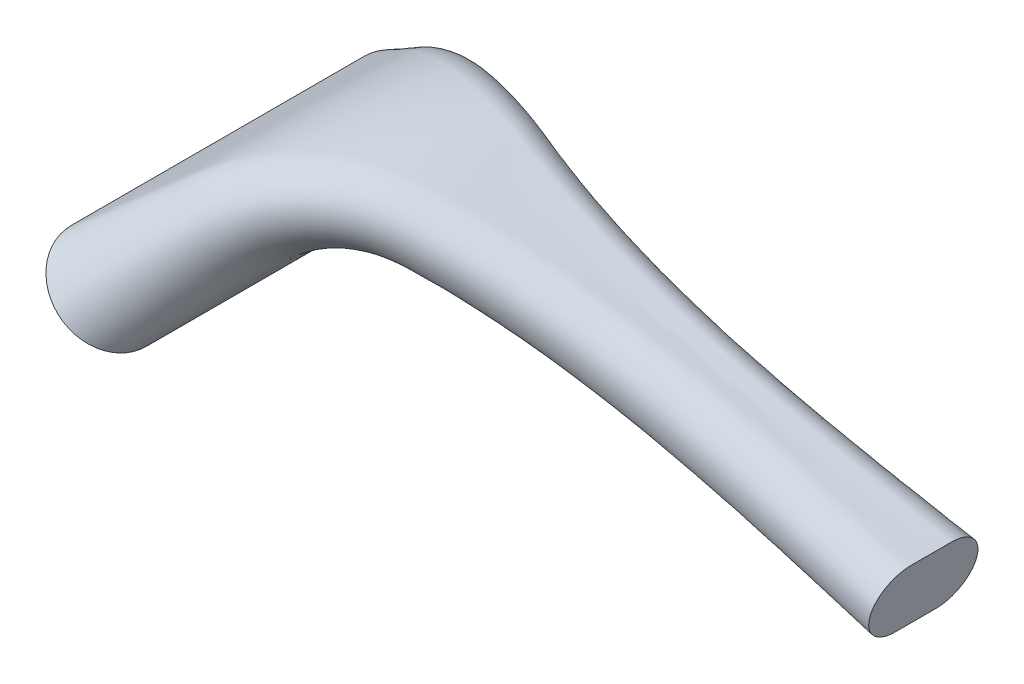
ISO-10303-21;
HEADER;
FILE_DESCRIPTION(('STEP AP214'),'2;1');
FILE_NAME('part.step','',(''),(''),'','','');
FILE_SCHEMA(('AUTOMOTIVE_DESIGN { 1 0 10303 214 1 1 1 1 }'));
ENDSEC;
DATA;
#1=APPLICATION_CONTEXT('core data for automotive mechanical design processes');
#2=APPLICATION_PROTOCOL_DEFINITION('international standard','automotive_design',2000,#1);
#3=PRODUCT_CONTEXT('',#1,'mechanical');
#4=PRODUCT('Part','Part','',(#3));
#5=PRODUCT_RELATED_PRODUCT_CATEGORY('part','',(#4));
#6=PRODUCT_DEFINITION_FORMATION('','',#4);
#7=PRODUCT_DEFINITION_CONTEXT('part definition',#1,'design');
#8=PRODUCT_DEFINITION('design','',#6,#7);
#9=PRODUCT_DEFINITION_SHAPE('','',#8);
#10=(LENGTH_UNIT() NAMED_UNIT(*) SI_UNIT(.MILLI.,.METRE.));
#11=(NAMED_UNIT(*) PLANE_ANGLE_UNIT() SI_UNIT($,.RADIAN.));
#12=(NAMED_UNIT(*) SI_UNIT($,.STERADIAN.) SOLID_ANGLE_UNIT());
#13=UNCERTAINTY_MEASURE_WITH_UNIT(LENGTH_MEASURE(1.E-05),#10,'distance_accuracy_value','');
#14=(GEOMETRIC_REPRESENTATION_CONTEXT(3) GLOBAL_UNCERTAINTY_ASSIGNED_CONTEXT((#13)) GLOBAL_UNIT_ASSIGNED_CONTEXT((#10,
#11,#12)) REPRESENTATION_CONTEXT('',''));
#15=CARTESIAN_POINT('',(0.,0.,0.));
#16=DIRECTION('',(0.,0.,1.));
#17=DIRECTION('',(1.,0.,0.));
#18=AXIS2_PLACEMENT_3D('',#15,#16,#17);
#19=CARTESIAN_POINT('',(-99.3908883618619,0.,21.79));
#20=DIRECTION('',(0.666922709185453,0.74512690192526,0.));
#21=DIRECTION('',(-0.74512690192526,0.666922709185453,0.));
#22=AXIS2_PLACEMENT_3D('',#19,#20,#21);
#23=PLANE('',#22);
#24=CARTESIAN_POINT('',(-99.3908883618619,0.,21.79));
#25=DIRECTION('',(0.666922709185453,0.74512690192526,0.));
#26=DIRECTION('',(-0.74512690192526,0.666922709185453,0.));
#27=AXIS2_PLACEMENT_3D('',#24,#25,#26);
#28=CIRCLE('',#27,7.49999999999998);
#29=CARTESIAN_POINT('',(-104.979340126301,5.00192031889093,21.79));
#30=VERTEX_POINT('',#29);
#31=CARTESIAN_POINT('',(-93.8024365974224,-5.00192031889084,21.79));
#32=VERTEX_POINT('',#31);
#33=EDGE_CURVE('E264',#30,#32,#28,.T.);
#34=ORIENTED_EDGE('',*,*,#33,.F.);
#35=DIRECTION('',(0.,0.,1.));
#36=VECTOR('',#35,1.);
#37=CARTESIAN_POINT('',(-104.979340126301,5.00192031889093,21.79));
#38=LINE('',#37,#36);
#39=CARTESIAN_POINT('',(-104.979340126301,5.00192031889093,-21.79));
#40=VERTEX_POINT('',#39);
#41=EDGE_CURVE('E272',#40,#30,#38,.T.);
#42=ORIENTED_EDGE('',*,*,#41,.F.);
#43=CARTESIAN_POINT('',(-99.3908883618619,0.,-21.79));
#44=DIRECTION('',(0.666922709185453,0.74512690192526,0.));
#45=DIRECTION('',(-0.74512690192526,0.666922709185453,0.));
#46=AXIS2_PLACEMENT_3D('',#43,#44,#45);
#47=CIRCLE('',#46,7.49999999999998);
#48=CARTESIAN_POINT('',(-93.8024365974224,-5.00192031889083,-21.79));
#49=VERTEX_POINT('',#48);
#50=EDGE_CURVE('E257',#49,#40,#47,.T.);
#51=ORIENTED_EDGE('',*,*,#50,.F.);
#52=DIRECTION('',(0.,0.,-1.));
#53=VECTOR('',#52,1.);
#54=CARTESIAN_POINT('',(-93.8024365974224,-5.00192031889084,21.79));
#55=LINE('',#54,#53);
#56=EDGE_CURVE('E261',#32,#49,#55,.T.);
#57=ORIENTED_EDGE('',*,*,#56,.F.);
#58=EDGE_LOOP('',(#34,#42,#51,#57));
#59=FACE_BOUND('',#58,.T.);
#60=ADVANCED_FACE('F218',(#59),#23,.F.);
#61=CARTESIAN_POINT('',(0.,0.,-3.));
#62=DIRECTION('',(0.972613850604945,-0.23242697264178,0.));
#63=DIRECTION('',(0.23242697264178,0.972613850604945,0.));
#64=AXIS2_PLACEMENT_3D('',#61,#62,#63);
#65=PLANE('',#64);
#66=CARTESIAN_POINT('',(0.,0.,-3.));
#67=DIRECTION('',(-0.972613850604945,0.23242697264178,0.));
#68=DIRECTION('',(0.23242697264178,0.972613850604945,0.));
#69=AXIS2_PLACEMENT_3D('',#66,#67,#68);
#70=CIRCLE('',#69,5.);
#71=CARTESIAN_POINT('',(1.1621348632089,4.86306925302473,-3.00000000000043));
#72=VERTEX_POINT('',#71);
#73=CARTESIAN_POINT('',(-1.1621348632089,-4.86306925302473,-3.));
#74=VERTEX_POINT('',#73);
#75=EDGE_CURVE('E337',#72,#74,#70,.T.);
#76=ORIENTED_EDGE('',*,*,#75,.F.);
#77=DIRECTION('',(0.,0.,-1.));
#78=VECTOR('',#77,1.);
#79=CARTESIAN_POINT('',(1.1621348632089,4.86306925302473,-3.));
#80=LINE('',#79,#78);
#81=CARTESIAN_POINT('',(1.1621348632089,4.86306925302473,3.000000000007));
#82=VERTEX_POINT('',#81);
#83=EDGE_CURVE('E363',#82,#72,#80,.T.);
#84=ORIENTED_EDGE('',*,*,#83,.F.);
#85=CARTESIAN_POINT('',(0.,0.,3.));
#86=DIRECTION('',(-0.972613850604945,0.23242697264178,0.));
#87=DIRECTION('',(0.23242697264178,0.972613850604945,0.));
#88=AXIS2_PLACEMENT_3D('',#85,#86,#87);
#89=CIRCLE('',#88,5.);
#90=CARTESIAN_POINT('',(-1.1621348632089,-4.86306925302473,3.));
#91=VERTEX_POINT('',#90);
#92=EDGE_CURVE('E229',#91,#82,#89,.T.);
#93=ORIENTED_EDGE('',*,*,#92,.F.);
#94=DIRECTION('',(0.,0.,1.));
#95=VECTOR('',#94,1.);
#96=CARTESIAN_POINT('',(-1.1621348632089,-4.86306925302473,3.));
#97=LINE('',#96,#95);
#98=EDGE_CURVE('E13',#74,#91,#97,.T.);
#99=ORIENTED_EDGE('',*,*,#98,.F.);
#100=EDGE_LOOP('',(#76,#84,#93,#99));
#101=FACE_BOUND('',#100,.T.);
#102=ADVANCED_FACE('F294',(#101),#65,.T.);
#103=CARTESIAN_POINT('',(1.1621348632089,4.86306925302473,0.));
#104=CARTESIAN_POINT('',(-8.07825543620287,7.13517180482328,0.));
#105=CARTESIAN_POINT('',(-21.9388408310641,10.5433261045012,0.));
#106=CARTESIAN_POINT('',(-42.7297191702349,15.6555554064,0.));
#107=CARTESIAN_POINT('',(-55.1465646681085,18.7080752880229,0.));
#108=CARTESIAN_POINT('',(-63.2811756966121,20.7096557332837,0.));
#109=CARTESIAN_POINT('',(-64.7251917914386,21.0625683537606,0.));
#110=CARTESIAN_POINT('',(-65.8802476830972,21.3467543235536,0.));
#111=CARTESIAN_POINT('',(-69.0059794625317,22.1306809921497,0.));
#112=CARTESIAN_POINT('',(-75.7490934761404,22.7232616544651,0.));
#113=CARTESIAN_POINT('',(-82.0537115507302,21.3498420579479,0.));
#114=CARTESIAN_POINT('',(-88.1636781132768,18.6472190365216,0.));
#115=CARTESIAN_POINT('',(-90.9055299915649,16.9138164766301,0.));
#116=CARTESIAN_POINT('',(-97.0194325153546,11.7030782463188,0.));
#117=CARTESIAN_POINT('',(-101.118538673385,8.26520928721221,0.));
#118=CARTESIAN_POINT('',(-104.979340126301,5.00192031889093,0.));
#119=CARTESIAN_POINT('',(1.1621348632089,4.86306925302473,-0.25));
#120=CARTESIAN_POINT('',(-8.07825543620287,7.13517180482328,-0.214849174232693));
#121=CARTESIAN_POINT('',(-21.9388408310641,10.5433261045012,-0.162122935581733));
#122=CARTESIAN_POINT('',(-42.7297191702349,15.6555554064,-0.208406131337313));
#123=CARTESIAN_POINT('',(-55.1465646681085,18.7080752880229,-0.329641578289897));
#124=CARTESIAN_POINT('',(-63.2811756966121,20.7096557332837,-0.471151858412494));
#125=CARTESIAN_POINT('',(-64.7251917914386,21.0625683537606,-0.498041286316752));
#126=CARTESIAN_POINT('',(-65.8802476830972,21.3467543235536,-0.520243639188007));
#127=CARTESIAN_POINT('',(-69.0059794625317,22.1306809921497,-0.582953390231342));
#128=CARTESIAN_POINT('',(-75.7490934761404,22.7232616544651,-0.734922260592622));
#129=CARTESIAN_POINT('',(-82.0537115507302,21.3498420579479,-0.911842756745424));
#130=CARTESIAN_POINT('',(-88.1636781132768,18.6472190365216,-1.11182650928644));
#131=CARTESIAN_POINT('',(-90.9055299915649,16.9138164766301,-1.21241918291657));
#132=CARTESIAN_POINT('',(-97.0194325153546,11.7030782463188,-1.46742564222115));
#133=CARTESIAN_POINT('',(-101.118538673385,8.26520928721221,-1.64660674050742));
#134=CARTESIAN_POINT('',(-104.979340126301,5.00192031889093,-1.81583333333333));
#135=CARTESIAN_POINT('',(1.1621348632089,4.86306925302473,-0.706641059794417));
#136=CARTESIAN_POINT('',(-8.07632954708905,7.1361642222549,-0.557388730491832));
#137=CARTESIAN_POINT('',(-21.934861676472,10.5460067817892,-0.333510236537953));
#138=CARTESIAN_POINT('',(-42.7247735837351,15.6586942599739,-0.458246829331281));
#139=CARTESIAN_POINT('',(-55.1429901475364,18.7100211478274,-0.876558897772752));
#140=CARTESIAN_POINT('',(-63.280524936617,20.7099788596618,-1.3786768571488));
#141=CARTESIAN_POINT('',(-64.7251382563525,21.0627009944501,-1.47431006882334));
#142=CARTESIAN_POINT('',(-65.8806668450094,21.3465196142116,-1.5533543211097));
#143=CARTESIAN_POINT('',(-69.0075583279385,22.1279448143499,-1.77690692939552));
#144=CARTESIAN_POINT('',(-75.7513478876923,22.7135706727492,-2.32069671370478));
#145=CARTESIAN_POINT('',(-82.0534765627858,21.3337377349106,-2.95677489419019));
#146=CARTESIAN_POINT('',(-88.1591711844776,18.626581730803,-3.6769466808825));
#147=CARTESIAN_POINT('',(-90.9002135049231,16.8940091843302,-4.03955406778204));
#148=CARTESIAN_POINT('',(-97.0162834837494,11.6917162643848,-4.9593352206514));
#149=CARTESIAN_POINT('',(-101.116971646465,8.25964063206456,-5.60623347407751));
#150=CARTESIAN_POINT('',(-104.979340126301,5.00192031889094,-6.21719293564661));
#151=CARTESIAN_POINT('',(1.1621348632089,4.86306925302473,-1.33168796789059));
#152=CARTESIAN_POINT('',(-8.06831188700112,7.14029575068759,-0.987202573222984));
#153=CARTESIAN_POINT('',(-21.9182960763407,10.5571666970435,-0.470474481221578));
#154=CARTESIAN_POINT('',(-42.7041846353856,15.6717616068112,-0.713333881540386));
#155=CARTESIAN_POINT('',(-55.1281090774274,18.7181219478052,-1.61830401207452));
#156=CARTESIAN_POINT('',(-63.2778157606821,20.7113240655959,-2.7152723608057));
#157=CARTESIAN_POINT('',(-64.7249153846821,21.0632531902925,-2.92436727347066));
#158=CARTESIAN_POINT('',(-65.8824118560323,21.345542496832,-3.09725217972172));
#159=CARTESIAN_POINT('',(-69.0141312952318,22.11655384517,-3.58642523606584));
#160=CARTESIAN_POINT('',(-75.760733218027,22.6732261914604,-4.77785855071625));
#161=CARTESIAN_POINT('',(-82.052498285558,21.2666939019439,-6.17373071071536));
#162=CARTESIAN_POINT('',(-88.1404084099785,18.5406666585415,-7.75501668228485));
#163=CARTESIAN_POINT('',(-90.8780804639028,16.8115495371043,-8.55146093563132));
#164=CARTESIAN_POINT('',(-97.0031737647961,11.6444152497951,-10.5721138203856));
#165=CARTESIAN_POINT('',(-101.110447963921,8.236457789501,-11.9937259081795));
#166=CARTESIAN_POINT('',(-104.979340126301,5.00192031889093,-13.3363595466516));
#167=CARTESIAN_POINT('',(1.1621348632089,4.86306925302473,-2.0522440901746));
#168=CARTESIAN_POINT('',(-8.05581424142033,7.14673583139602,-1.63791957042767));
#169=CARTESIAN_POINT('',(-21.8924742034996,10.5745623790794,-1.01643279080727));
#170=CARTESIAN_POINT('',(-42.6720913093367,15.6921305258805,-1.41786674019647));
#171=CARTESIAN_POINT('',(-55.1049129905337,18.7307491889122,-2.65322932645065));
#172=CARTESIAN_POINT('',(-63.2735927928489,20.7134209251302,-4.12299089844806));
#173=CARTESIAN_POINT('',(-64.7245679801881,21.0641139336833,-4.40271700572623));
#174=CARTESIAN_POINT('',(-65.8851319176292,21.3440194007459,-4.63384646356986));
#175=CARTESIAN_POINT('',(-69.0243770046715,22.0987980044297,-5.28725545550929));
#176=CARTESIAN_POINT('',(-75.77536273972,22.6103386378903,-6.8748005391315));
#177=CARTESIAN_POINT('',(-82.0509733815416,21.1621883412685,-8.7290338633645));
#178=CARTESIAN_POINT('',(-88.1111616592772,18.4067452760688,-10.8273424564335));
#179=CARTESIAN_POINT('',(-90.8435802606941,16.683014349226,-11.8835191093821));
#180=CARTESIAN_POINT('',(-96.9827387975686,11.5706840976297,-14.5620872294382));
#181=CARTESIAN_POINT('',(-101.100279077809,8.20032119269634,-16.4454184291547));
#182=CARTESIAN_POINT('',(-104.979340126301,5.00192031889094,-18.2241201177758));
#183=CARTESIAN_POINT('',(1.1621348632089,4.86306925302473,-2.54841772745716));
#184=CARTESIAN_POINT('',(-8.04492838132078,7.15234535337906,-2.14418863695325));
#185=CARTESIAN_POINT('',(-21.8699825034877,10.5897145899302,-1.5378450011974));
#186=CARTESIAN_POINT('',(-42.6441369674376,15.7098725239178,-2.07892600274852));
#187=CARTESIAN_POINT('',(-55.0847084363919,18.7417479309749,-3.48498214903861));
#188=CARTESIAN_POINT('',(-63.2699144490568,20.7152473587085,-5.12447652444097));
#189=CARTESIAN_POINT('',(-64.7242653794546,21.0648636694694,-5.43598181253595));
#190=CARTESIAN_POINT('',(-65.8875011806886,21.3426927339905,-5.69317891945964));
#191=CARTESIAN_POINT('',(-69.0333013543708,22.0833320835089,-6.41958665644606));
#192=CARTESIAN_POINT('',(-75.7881055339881,22.5555615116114,-8.17968980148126));
#193=CARTESIAN_POINT('',(-82.0496451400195,21.0711605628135,-10.2284130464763));
#194=CARTESIAN_POINT('',(-88.085686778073,18.2900953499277,-12.5440621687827));
#195=CARTESIAN_POINT('',(-90.8135294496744,16.5710559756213,-13.7087994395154));
#196=CARTESIAN_POINT('',(-96.9649392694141,11.5064618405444,-16.66138658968));
#197=CARTESIAN_POINT('',(-101.091421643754,8.16884502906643,-18.7359561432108));
#198=CARTESIAN_POINT('',(-104.979340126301,5.00192031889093,-20.6952718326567));
#199=CARTESIAN_POINT('',(1.1621348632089,4.86306925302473,-3.27685366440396));
#200=CARTESIAN_POINT('',(-8.03529297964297,7.15731050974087,-2.84426540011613));
#201=CARTESIAN_POINT('',(-21.8500744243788,10.6031262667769,-2.19538300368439));
#202=CARTESIAN_POINT('',(-42.6193937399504,15.725576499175,-2.75955895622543));
#203=CARTESIAN_POINT('',(-55.0668247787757,18.7514832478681,-4.24428349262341));
#204=CARTESIAN_POINT('',(-63.2666586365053,20.7168639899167,-5.97835080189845));
#205=CARTESIAN_POINT('',(-64.7239975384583,21.0655272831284,-6.30787066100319));
#206=CARTESIAN_POINT('',(-65.8895982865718,21.3415184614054,-6.57995826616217));
#207=CARTESIAN_POINT('',(-69.041200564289,22.0696427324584,-7.34848221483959));
#208=CARTESIAN_POINT('',(-75.7993845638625,22.5070766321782,-9.21105318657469));
#209=CARTESIAN_POINT('',(-82.0484694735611,20.9905891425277,-11.3796645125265));
#210=CARTESIAN_POINT('',(-88.0631381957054,18.1868449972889,-13.8310634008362));
#211=CARTESIAN_POINT('',(-90.7869305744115,16.4719582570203,-15.0641544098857));
#212=CARTESIAN_POINT('',(-96.9491843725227,11.4496167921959,-18.1901315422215));
#213=CARTESIAN_POINT('',(-101.083581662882,8.14098453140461,-20.3866553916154));
#214=CARTESIAN_POINT('',(-104.979340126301,5.00192031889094,-22.4611501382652));
#215=CARTESIAN_POINT('',(1.15138618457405,4.81809033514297,-3.8448825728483));
#216=CARTESIAN_POINT('',(-8.04795615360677,7.11650133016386,-3.39664234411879));
#217=CARTESIAN_POINT('',(-21.8689599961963,10.569372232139,-2.72428200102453));
#218=CARTESIAN_POINT('',(-42.6398990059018,15.689426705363,-3.3061210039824));
#219=CARTESIAN_POINT('',(-55.0840243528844,18.7045420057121,-4.84087067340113));
#220=CARTESIAN_POINT('',(-63.2817982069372,20.6571717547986,-6.63389743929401));
#221=CARTESIAN_POINT('',(-64.7388564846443,21.0038970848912,-6.97462973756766));
#222=CARTESIAN_POINT('',(-65.9041231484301,21.2774502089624,-7.25597866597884));
#223=CARTESIAN_POINT('',(-69.0540036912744,21.9928343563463,-8.05067299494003));
#224=CARTESIAN_POINT('',(-75.7989378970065,22.3959271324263,-9.97674814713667));
#225=CARTESIAN_POINT('',(-82.0187002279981,20.8463771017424,-12.2194136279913));
#226=CARTESIAN_POINT('',(-87.9940795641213,18.016218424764,-14.7545685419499));
#227=CARTESIAN_POINT('',(-90.7033889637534,16.3005366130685,-16.0298038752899));
#228=CARTESIAN_POINT('',(-96.8457079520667,11.3016388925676,-19.2626414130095));
#229=CARTESIAN_POINT('',(-100.966179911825,8.00894875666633,-21.5342761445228));
#230=CARTESIAN_POINT('',(-104.849079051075,4.88533068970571,-23.6797089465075));
#231=CARTESIAN_POINT('',(1.09893091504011,4.59858602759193,-4.71102931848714));
#232=CARTESIAN_POINT('',(-8.12142025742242,6.89984620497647,-4.24798901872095));
#233=CARTESIAN_POINT('',(-21.9794174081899,10.3583001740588,-3.55342856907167));
#234=CARTESIAN_POINT('',(-42.763133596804,15.4648560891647,-4.15541183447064));
#235=CARTESIAN_POINT('',(-55.1854332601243,18.4561175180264,-5.74208985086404));
#236=CARTESIAN_POINT('',(-63.3541773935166,20.383507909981,-7.5956024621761));
#237=CARTESIAN_POINT('',(-64.8057966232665,20.7262762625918,-7.94782609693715));
#238=CARTESIAN_POINT('',(-65.9663669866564,20.9952084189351,-8.23866257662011));
#239=CARTESIAN_POINT('',(-69.1015720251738,21.6880274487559,-9.06015145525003));
#240=CARTESIAN_POINT('',(-75.7951393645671,22.0311867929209,-11.0511410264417));
#241=CARTESIAN_POINT('',(-81.9309627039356,20.423795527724,-13.3693516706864));
#242=CARTESIAN_POINT('',(-87.8008606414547,17.5464198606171,-15.9898890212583));
#243=CARTESIAN_POINT('',(-90.4655797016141,15.8274916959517,-17.3080688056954));
#244=CARTESIAN_POINT('',(-96.5220433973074,10.8621183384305,-20.6497671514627));
#245=CARTESIAN_POINT('',(-100.582036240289,7.59224230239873,-22.9978876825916));
#246=CARTESIAN_POINT('',(-104.408294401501,4.49080823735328,-25.2155570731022));
#247=CARTESIAN_POINT('',(1.00605717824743,4.20994661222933,-5.56241809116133));
#248=CARTESIAN_POINT('',(-8.24850810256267,6.510217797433,-5.08722842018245));
#249=CARTESIAN_POINT('',(-22.1636956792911,9.96859056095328,-4.37444391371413));
#250=CARTESIAN_POINT('',(-42.9671509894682,15.0561786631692,-4.98494066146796));
#251=CARTESIAN_POINT('',(-55.3545360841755,18.022617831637,-6.60346581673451));
#252=CARTESIAN_POINT('',(-63.4745766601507,19.9257200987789,-8.49559534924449));
#253=CARTESIAN_POINT('',(-64.9169575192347,20.2648022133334,-8.85518002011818));
#254=CARTESIAN_POINT('',(-66.0696557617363,20.529251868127,-9.15210286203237));
#255=CARTESIAN_POINT('',(-69.181026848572,21.1992616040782,-9.99081320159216));
#256=CARTESIAN_POINT('',(-75.7993005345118,21.481802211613,-12.023749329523));
#257=CARTESIAN_POINT('',(-81.8207164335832,19.8170307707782,-14.3911068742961));
#258=CARTESIAN_POINT('',(-87.5495883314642,16.8944102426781,-17.0673203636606));
#259=CARTESIAN_POINT('',(-90.1523322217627,15.1747329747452,-18.4135427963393));
#260=CARTESIAN_POINT('',(-96.0806333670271,10.2522563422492,-21.8263884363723));
#261=CARTESIAN_POINT('',(-100.050226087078,7.01181092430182,-24.2245645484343));
#262=CARTESIAN_POINT('',(-103.791618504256,3.93885506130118,-26.4895086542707));
#263=CARTESIAN_POINT('',(0.872339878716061,3.65039323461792,-6.35455589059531));
#264=CARTESIAN_POINT('',(-8.42570514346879,5.94785851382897,-5.86793908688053));
#265=CARTESIAN_POINT('',(-22.4123059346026,9.4035021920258,-5.13801388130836));
#266=CARTESIAN_POINT('',(-43.2394494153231,14.4725876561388,-5.74643207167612));
#267=CARTESIAN_POINT('',(-55.5814437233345,17.4178264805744,-7.38135817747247));
#268=CARTESIAN_POINT('',(-63.63768829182,19.3012828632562,-9.29593535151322));
#269=CARTESIAN_POINT('',(-65.0679249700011,19.6376146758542,-9.65983843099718));
#270=CARTESIAN_POINT('',(-66.2103241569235,19.8982760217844,-9.96034621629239));
#271=CARTESIAN_POINT('',(-69.2908664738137,20.5468796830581,-10.8092524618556));
#272=CARTESIAN_POINT('',(-75.8155694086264,20.7719297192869,-12.8673835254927));
#273=CARTESIAN_POINT('',(-81.6992955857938,19.0541826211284,-15.2647893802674));
#274=CARTESIAN_POINT('',(-87.259971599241,16.0923930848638,-17.9752485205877));
#275=CARTESIAN_POINT('',(-89.787506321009,14.3762431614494,-19.3387820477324));
#276=CARTESIAN_POINT('',(-95.555598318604,9.50998591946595,-22.7956448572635));
#277=CARTESIAN_POINT('',(-99.4121471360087,6.30829991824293,-25.2248955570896));
#278=CARTESIAN_POINT('',(-103.047316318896,3.27267051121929,-27.5191878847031));
#279=CARTESIAN_POINT('',(0.697353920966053,2.91814704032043,-7.04294971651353));
#280=CARTESIAN_POINT('',(-8.65038008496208,5.21380131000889,-6.54424017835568));
#281=CARTESIAN_POINT('',(-22.7179674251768,8.66827024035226,-5.79617587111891));
#282=CARTESIAN_POINT('',(-43.5701442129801,13.7256187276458,-6.39321253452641));
#283=CARTESIAN_POINT('',(-55.8579501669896,16.6570334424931,-8.03315672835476));
#284=CARTESIAN_POINT('',(-63.8384941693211,18.5279299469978,-9.95885897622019));
#285=CARTESIAN_POINT('',(-65.2543047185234,18.8628712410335,-10.3249604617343));
#286=CARTESIAN_POINT('',(-66.3845023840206,19.1207933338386,-10.6273141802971));
#287=CARTESIAN_POINT('',(-69.4287444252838,19.7504684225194,-11.4815463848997));
#288=CARTESIAN_POINT('',(-75.8456528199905,19.9235406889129,-13.5533598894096));
#289=CARTESIAN_POINT('',(-81.5736688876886,18.1594435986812,-15.9678373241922));
#290=CARTESIAN_POINT('',(-86.9451531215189,15.1666947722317,-18.6980403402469));
#291=CARTESIAN_POINT('',(-89.3872806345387,13.4591299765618,-20.0716412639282));
#292=CARTESIAN_POINT('',(-94.970539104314,8.66382455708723,-23.5542371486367));
#293=CARTESIAN_POINT('',(-98.6966696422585,5.51114195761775,-26.0018017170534));
#294=CARTESIAN_POINT('',(-102.209229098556,2.52254405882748,-28.3133904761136));
#295=CARTESIAN_POINT('',(0.418111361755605,1.74962869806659,-7.75975582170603));
#296=CARTESIAN_POINT('',(-9.00124311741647,4.04572383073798,-7.24649963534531));
#297=CARTESIAN_POINT('',(-23.1851247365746,7.5029717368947,-6.47661535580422));
#298=CARTESIAN_POINT('',(-44.0708113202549,12.5557453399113,-7.05416927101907));
#299=CARTESIAN_POINT('',(-56.277350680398,15.4787687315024,-8.69236734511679));
#300=CARTESIAN_POINT('',(-64.1452493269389,17.3418109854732,-10.6234855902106));
#301=CARTESIAN_POINT('',(-65.5395869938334,17.6765803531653,-10.990735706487));
#302=CARTESIAN_POINT('',(-66.6516523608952,17.9321576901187,-11.2940813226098));
#303=CARTESIAN_POINT('',(-69.6421418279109,18.5397746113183,-12.1512738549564));
#304=CARTESIAN_POINT('',(-75.9014553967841,18.6505662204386,-14.2313589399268));
#305=CARTESIAN_POINT('',(-81.4043479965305,16.83277016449,-16.657082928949));
#306=CARTESIAN_POINT('',(-86.5031955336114,13.8085090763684,-19.4006309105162));
#307=CARTESIAN_POINT('',(-88.8215695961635,12.1181984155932,-20.7811370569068));
#308=CARTESIAN_POINT('',(-94.1345903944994,7.43407547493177,-24.2815376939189));
#309=CARTESIAN_POINT('',(-97.6700594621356,4.35821542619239,-26.7419417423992));
#310=CARTESIAN_POINT('',(-101.003323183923,1.443203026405,-29.0656566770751));
#311=CARTESIAN_POINT('',(0.,0.,-8.16117715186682));
#312=CARTESIAN_POINT('',(-9.51396670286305,2.30529498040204,-7.63763145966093));
#313=CARTESIAN_POINT('',(-23.8511704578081,5.77906725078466,-6.85231292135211));
#314=CARTESIAN_POINT('',(-44.7760979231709,10.8509352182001,-7.41276450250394));
#315=CARTESIAN_POINT('',(-56.8687346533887,13.7822296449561,-9.04526446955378));
#316=CARTESIAN_POINT('',(-64.5809167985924,15.6504102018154,-10.975645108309));
#317=CARTESIAN_POINT('',(-65.9455796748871,15.9877424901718,-11.3428498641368));
#318=CARTESIAN_POINT('',(-67.0326259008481,16.2425609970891,-11.646192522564));
#319=CARTESIAN_POINT('',(-69.9491861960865,16.8280261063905,-12.5035026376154));
#320=CARTESIAN_POINT('',(-75.9941940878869,16.8727482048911,-14.5847434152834));
#321=CARTESIAN_POINT('',(-81.1940297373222,15.0007112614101,-17.0130955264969));
#322=CARTESIAN_POINT('',(-85.9269516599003,11.9520952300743,-19.7601158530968));
#323=CARTESIAN_POINT('',(-88.0784864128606,10.2919452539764,-21.1425214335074));
#324=CARTESIAN_POINT('',(-93.0245117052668,5.77076995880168,-24.6479749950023));
#325=CARTESIAN_POINT('',(-96.3011144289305,2.80742337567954,-27.11219042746));
#326=CARTESIAN_POINT('',(-99.3908883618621,0.,-29.4395050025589));
#327=CARTESIAN_POINT('',(-0.418111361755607,-1.74962869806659,-7.75975582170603));
#328=CARTESIAN_POINT('',(-10.0266902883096,0.564866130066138,-7.24649963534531));
#329=CARTESIAN_POINT('',(-24.5172161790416,4.0551627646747,-6.47661535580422));
#330=CARTESIAN_POINT('',(-45.4813845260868,9.14612509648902,-7.05416927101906));
#331=CARTESIAN_POINT('',(-57.4601186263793,12.0856905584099,-8.69236734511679));
#332=CARTESIAN_POINT('',(-65.0165842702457,13.9590094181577,-10.6234855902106));
#333=CARTESIAN_POINT('',(-66.3515723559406,14.2989046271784,-10.990735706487));
#334=CARTESIAN_POINT('',(-67.4135994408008,14.5529643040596,-11.2940813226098));
#335=CARTESIAN_POINT('',(-70.2562305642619,15.1162776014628,-12.1512738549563));
#336=CARTESIAN_POINT('',(-76.0869327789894,15.0949301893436,-14.2313589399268));
#337=CARTESIAN_POINT('',(-80.9837114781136,13.1686523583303,-16.657082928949));
#338=CARTESIAN_POINT('',(-85.3507077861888,10.0956813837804,-19.4006309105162));
#339=CARTESIAN_POINT('',(-87.3354032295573,8.46569209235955,-20.7811370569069));
#340=CARTESIAN_POINT('',(-91.9144330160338,4.10746444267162,-24.2815376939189));
#341=CARTESIAN_POINT('',(-94.9321693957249,1.2566313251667,-26.7419417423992));
#342=CARTESIAN_POINT('',(-97.7784535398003,-1.44320302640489,-29.0656566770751));
#343=CARTESIAN_POINT('',(-0.697353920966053,-2.91814704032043,-7.04294971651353));
#344=CARTESIAN_POINT('',(-10.377553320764,-0.603211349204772,-6.54424017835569));
#345=CARTESIAN_POINT('',(-24.9843734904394,2.88986426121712,-5.79617587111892));
#346=CARTESIAN_POINT('',(-45.9820516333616,7.97625170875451,-6.39321253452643));
#347=CARTESIAN_POINT('',(-57.8795191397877,10.9074258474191,-8.03315672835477));
#348=CARTESIAN_POINT('',(-65.3233394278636,12.7728904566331,-9.9588589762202));
#349=CARTESIAN_POINT('',(-66.6368546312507,13.1126137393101,-10.3249604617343));
#350=CARTESIAN_POINT('',(-67.6807494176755,13.3643286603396,-10.6273141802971));
#351=CARTESIAN_POINT('',(-70.4696279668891,13.9055837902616,-11.4815463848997));
#352=CARTESIAN_POINT('',(-76.1427353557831,13.8219557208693,-13.5533598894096));
#353=CARTESIAN_POINT('',(-80.8143905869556,11.8419789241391,-15.9678373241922));
#354=CARTESIAN_POINT('',(-84.9087501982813,8.73749568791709,-18.6980403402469));
#355=CARTESIAN_POINT('',(-86.7696921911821,7.12476053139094,-20.0716412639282));
#356=CARTESIAN_POINT('',(-91.0784843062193,2.87771536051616,-23.5542371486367));
#357=CARTESIAN_POINT('',(-93.9055592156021,0.103704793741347,-26.0018017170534));
#358=CARTESIAN_POINT('',(-96.5725476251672,-2.52254405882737,-28.3133904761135));
#359=CARTESIAN_POINT('',(-0.872339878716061,-3.65039323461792,-6.35455589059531));
#360=CARTESIAN_POINT('',(-10.6022282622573,-1.33726855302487,-5.86793908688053));
#361=CARTESIAN_POINT('',(-25.2900349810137,2.15463230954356,-5.13801388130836));
#362=CARTESIAN_POINT('',(-46.3127464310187,7.22928278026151,-5.74643207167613));
#363=CARTESIAN_POINT('',(-58.1560255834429,10.1466328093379,-7.38135817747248));
#364=CARTESIAN_POINT('',(-65.5241453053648,11.9995375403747,-9.29593535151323));
#365=CARTESIAN_POINT('',(-66.823234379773,12.3378703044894,-9.6598384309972));
#366=CARTESIAN_POINT('',(-67.8549276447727,12.5868459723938,-9.9603462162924));
#367=CARTESIAN_POINT('',(-70.6075059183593,13.109172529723,-10.8092524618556));
#368=CARTESIAN_POINT('',(-76.1728187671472,12.9735666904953,-12.8673835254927));
#369=CARTESIAN_POINT('',(-80.6887638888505,10.9472399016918,-15.2647893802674));
#370=CARTESIAN_POINT('',(-84.5939317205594,7.81179737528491,-17.9752485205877));
#371=CARTESIAN_POINT('',(-86.3694665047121,6.20764734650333,-19.3387820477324));
#372=CARTESIAN_POINT('',(-90.4934250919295,2.03155399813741,-22.7956448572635));
#373=CARTESIAN_POINT('',(-93.1900817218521,-0.693453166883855,-25.2248955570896));
#374=CARTESIAN_POINT('',(-95.7344604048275,-3.27267051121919,-27.5191878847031));
#375=CARTESIAN_POINT('',(-1.00605717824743,-4.20994661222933,-5.56241809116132));
#376=CARTESIAN_POINT('',(-10.7794253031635,-1.89962783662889,-5.08722842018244));
#377=CARTESIAN_POINT('',(-25.5386452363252,1.58954394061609,-4.37444391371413));
#378=CARTESIAN_POINT('',(-46.5850448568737,6.64569177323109,-4.98494066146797));
#379=CARTESIAN_POINT('',(-58.382933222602,9.54184145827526,-6.60346581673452));
#380=CARTESIAN_POINT('',(-65.6872569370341,11.375100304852,-8.4955953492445));
#381=CARTESIAN_POINT('',(-66.9742018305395,11.7106827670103,-8.85518002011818));
#382=CARTESIAN_POINT('',(-67.9955960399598,11.9558701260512,-9.15210286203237));
#383=CARTESIAN_POINT('',(-70.7173455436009,12.4567906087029,-9.99081320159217));
#384=CARTESIAN_POINT('',(-76.1890876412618,12.2636941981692,-12.023749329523));
#385=CARTESIAN_POINT('',(-80.567343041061,10.184391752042,-14.3911068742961));
#386=CARTESIAN_POINT('',(-84.3043149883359,7.00978021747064,-17.0673203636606));
#387=CARTESIAN_POINT('',(-86.004640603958,5.40915753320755,-18.4135427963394));
#388=CARTESIAN_POINT('',(-89.9683900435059,1.28928357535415,-21.8263884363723));
#389=CARTESIAN_POINT('',(-92.5520027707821,-1.39696417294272,-24.2245645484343));
#390=CARTESIAN_POINT('',(-94.990158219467,-3.93885506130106,-26.4895086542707));
#391=CARTESIAN_POINT('',(-1.09893091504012,-4.59858602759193,-4.71102931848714));
#392=CARTESIAN_POINT('',(-10.9065131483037,-2.28925624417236,-4.24798901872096));
#393=CARTESIAN_POINT('',(-25.7229235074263,1.19983432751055,-3.55342856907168));
#394=CARTESIAN_POINT('',(-46.7890622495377,6.23701434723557,-4.15541183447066));
#395=CARTESIAN_POINT('',(-58.5520360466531,9.10834177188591,-5.74208985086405));
#396=CARTESIAN_POINT('',(-65.8076562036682,10.9173124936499,-7.5956024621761));
#397=CARTESIAN_POINT('',(-67.0853627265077,11.2492087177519,-7.94782609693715));
#398=CARTESIAN_POINT('',(-68.0988848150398,11.4899135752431,-8.23866257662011));
#399=CARTESIAN_POINT('',(-70.7968003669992,11.9680247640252,-9.06015145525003));
#400=CARTESIAN_POINT('',(-76.1932488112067,11.7143096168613,-11.0511410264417));
#401=CARTESIAN_POINT('',(-80.4570967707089,9.57762699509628,-13.3693516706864));
#402=CARTESIAN_POINT('',(-84.0530426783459,6.35777059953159,-15.9898890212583));
#403=CARTESIAN_POINT('',(-85.6913931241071,4.75639881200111,-17.3080688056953));
#404=CARTESIAN_POINT('',(-89.5269800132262,0.679421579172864,-20.6497671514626));
#405=CARTESIAN_POINT('',(-92.0201926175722,-1.97739555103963,-22.9978876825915));
#406=CARTESIAN_POINT('',(-94.3734823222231,-4.49080823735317,-25.2155570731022));
#407=CARTESIAN_POINT('',(-1.15138618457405,-4.81809033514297,-3.8448825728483));
#408=CARTESIAN_POINT('',(-10.9799772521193,-2.50591136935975,-3.39664234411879));
#409=CARTESIAN_POINT('',(-25.83338091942,0.988762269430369,-2.72428200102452));
#410=CARTESIAN_POINT('',(-46.9122968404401,6.01244373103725,-3.30612100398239));
#411=CARTESIAN_POINT('',(-58.6534449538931,8.85991728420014,-4.84087067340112));
#412=CARTESIAN_POINT('',(-65.8800353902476,10.6436486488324,-6.63389743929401));
#413=CARTESIAN_POINT('',(-67.1523028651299,10.9715878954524,-6.97462973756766));
#414=CARTESIAN_POINT('',(-68.161128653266,11.2076717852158,-7.25597866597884));
#415=CARTESIAN_POINT('',(-70.8443687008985,11.6632178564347,-8.05067299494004));
#416=CARTESIAN_POINT('',(-76.1894502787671,11.3495692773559,-9.97674814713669));
#417=CARTESIAN_POINT('',(-80.3693592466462,9.15504542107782,-12.2194136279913));
#418=CARTESIAN_POINT('',(-83.8598237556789,5.88797203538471,-14.7545685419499));
#419=CARTESIAN_POINT('',(-85.4535838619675,4.28335389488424,-16.0298038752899));
#420=CARTESIAN_POINT('',(-89.2033154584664,0.239901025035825,-19.2626414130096));
#421=CARTESIAN_POINT('',(-91.6360489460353,-2.39410200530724,-21.5342761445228));
#422=CARTESIAN_POINT('',(-93.9326976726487,-4.8853306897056,-23.6797089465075));
#423=CARTESIAN_POINT('',(-1.1621348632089,-4.86306925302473,-3.27685366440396));
#424=CARTESIAN_POINT('',(-10.9926404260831,-2.54672054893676,-2.84426540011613));
#425=CARTESIAN_POINT('',(-25.8522664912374,0.955008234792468,-2.19538300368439));
#426=CARTESIAN_POINT('',(-46.9328021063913,5.97629393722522,-2.75955895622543));
#427=CARTESIAN_POINT('',(-58.6706445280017,8.81297604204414,-4.24428349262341));
#428=CARTESIAN_POINT('',(-65.8951749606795,10.5839564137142,-5.97835080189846));
#429=CARTESIAN_POINT('',(-67.1671618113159,10.9099576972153,-6.30787066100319));
#430=CARTESIAN_POINT('',(-68.1756535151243,11.1436035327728,-6.57995826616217));
#431=CARTESIAN_POINT('',(-70.8571718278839,11.5864094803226,-7.34848221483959));
#432=CARTESIAN_POINT('',(-76.1890036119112,11.2384197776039,-9.21105318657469));
#433=CARTESIAN_POINT('',(-80.3395900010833,9.01083338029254,-11.3796645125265));
#434=CARTESIAN_POINT('',(-83.790765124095,5.71734546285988,-13.8310634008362));
#435=CARTESIAN_POINT('',(-85.3700422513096,4.11193225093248,-15.0641544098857));
#436=CARTESIAN_POINT('',(-89.0998390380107,0.0919231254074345,-18.1901315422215));
#437=CARTESIAN_POINT('',(-91.5186471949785,-2.52613778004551,-20.3866553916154));
#438=CARTESIAN_POINT('',(-93.8024365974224,-5.00192031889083,-22.4611501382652));
#439=CARTESIAN_POINT('',(-1.1621348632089,-4.86306925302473,-2.54841772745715));
#440=CARTESIAN_POINT('',(-10.9830050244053,-2.54175539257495,-2.14418863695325));
#441=CARTESIAN_POINT('',(-25.8323584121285,0.968419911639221,-1.5378450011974));
#442=CARTESIAN_POINT('',(-46.9080588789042,5.99199791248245,-2.07892600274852));
#443=CARTESIAN_POINT('',(-58.6527608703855,8.82271135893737,-3.48498214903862));
#444=CARTESIAN_POINT('',(-65.891919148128,10.5855730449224,-5.12447652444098));
#445=CARTESIAN_POINT('',(-67.1668939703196,10.9106213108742,-5.43598181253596));
#446=CARTESIAN_POINT('',(-68.1777506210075,11.1424292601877,-5.69317891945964));
#447=CARTESIAN_POINT('',(-70.8650710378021,11.5727201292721,-6.41958665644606));
#448=CARTESIAN_POINT('',(-76.2002826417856,11.1899348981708,-8.17968980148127));
#449=CARTESIAN_POINT('',(-80.3384143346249,8.93026196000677,-10.2284130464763));
#450=CARTESIAN_POINT('',(-83.7682165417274,5.61409511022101,-12.5440621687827));
#451=CARTESIAN_POINT('',(-85.3434433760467,4.01283453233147,-13.7087994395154));
#452=CARTESIAN_POINT('',(-89.0840841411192,0.0350780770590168,-16.66138658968));
#453=CARTESIAN_POINT('',(-91.5108072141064,-2.55399827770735,-18.7359561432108));
#454=CARTESIAN_POINT('',(-93.8024365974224,-5.00192031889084,-20.6952718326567));
#455=CARTESIAN_POINT('',(-1.1621348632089,-4.86306925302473,-2.0522440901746));
#456=CARTESIAN_POINT('',(-10.9721191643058,-2.53614587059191,-1.63791957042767));
#457=CARTESIAN_POINT('',(-25.8098667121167,0.983572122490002,-1.01643279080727));
#458=CARTESIAN_POINT('',(-46.8801045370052,6.00973991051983,-1.41786674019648));
#459=CARTESIAN_POINT('',(-58.6325563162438,8.83371010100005,-2.65322932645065));
#460=CARTESIAN_POINT('',(-65.888240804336,10.5873994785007,-4.12299089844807));
#461=CARTESIAN_POINT('',(-67.1665913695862,10.9113710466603,-4.40271700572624));
#462=CARTESIAN_POINT('',(-68.1801198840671,11.1411025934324,-4.63384646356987));
#463=CARTESIAN_POINT('',(-70.8739953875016,11.5572542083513,-5.2872554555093));
#464=CARTESIAN_POINT('',(-76.2130254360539,11.1351577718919,-6.87480053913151));
#465=CARTESIAN_POINT('',(-80.3370860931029,8.83923418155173,-8.72903386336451));
#466=CARTESIAN_POINT('',(-83.7427416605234,5.49744518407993,-10.8273424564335));
#467=CARTESIAN_POINT('',(-85.3133925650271,3.9008761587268,-11.8835191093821));
#468=CARTESIAN_POINT('',(-89.0662846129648,-0.0291441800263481,-14.5620872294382));
#469=CARTESIAN_POINT('',(-91.5019497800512,-2.58547444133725,-16.4454184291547));
#470=CARTESIAN_POINT('',(-93.8024365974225,-5.00192031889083,-18.2241201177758));
#471=CARTESIAN_POINT('',(-1.1621348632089,-4.86306925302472,-1.33168796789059));
#472=CARTESIAN_POINT('',(-10.9596215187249,-2.52970578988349,-0.987202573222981));
#473=CARTESIAN_POINT('',(-25.7840448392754,1.00096780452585,-0.470474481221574));
#474=CARTESIAN_POINT('',(-46.848011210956,6.03010882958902,-0.713333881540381));
#475=CARTESIAN_POINT('',(-58.6093602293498,8.84633734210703,-1.61830401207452));
#476=CARTESIAN_POINT('',(-65.8840178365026,10.589496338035,-2.7152723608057));
#477=CARTESIAN_POINT('',(-67.166243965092,10.9122317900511,-2.92436727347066));
#478=CARTESIAN_POINT('',(-68.1828399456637,11.1395794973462,-3.09725217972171));
#479=CARTESIAN_POINT('',(-70.8842410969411,11.539498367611,-3.58642523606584));
#480=CARTESIAN_POINT('',(-76.2276549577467,11.0722702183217,-4.77785855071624));
#481=CARTESIAN_POINT('',(-80.3355611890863,8.7347286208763,-6.17373071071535));
#482=CARTESIAN_POINT('',(-83.7134949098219,5.3635238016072,-7.75501668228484));
#483=CARTESIAN_POINT('',(-85.2788923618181,3.77234097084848,-8.55146093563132));
#484=CARTESIAN_POINT('',(-89.0458496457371,-0.102875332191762,-10.5721138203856));
#485=CARTESIAN_POINT('',(-91.4917808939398,-2.62161103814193,-11.9937259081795));
#486=CARTESIAN_POINT('',(-93.8024365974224,-5.00192031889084,-13.3363595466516));
#487=CARTESIAN_POINT('',(-1.1621348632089,-4.86306925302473,-0.706641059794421));
#488=CARTESIAN_POINT('',(-10.951603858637,-2.52557426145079,-0.557388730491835));
#489=CARTESIAN_POINT('',(-25.7674792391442,1.01212771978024,-0.333510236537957));
#490=CARTESIAN_POINT('',(-46.8274222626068,6.04317617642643,-0.458246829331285));
#491=CARTESIAN_POINT('',(-58.5944791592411,8.85443814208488,-0.876558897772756));
#492=CARTESIAN_POINT('',(-65.881308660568,10.5908415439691,-1.37867685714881));
#493=CARTESIAN_POINT('',(-67.1660210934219,10.9127839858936,-1.47431006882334));
#494=CARTESIAN_POINT('',(-68.184584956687,11.1386023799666,-1.5533543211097));
#495=CARTESIAN_POINT('',(-70.8908140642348,11.5281073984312,-1.77690692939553));
#496=CARTESIAN_POINT('',(-76.2370402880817,11.031925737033,-2.32069671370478));
#497=CARTESIAN_POINT('',(-80.3345829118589,8.66768478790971,-2.95677489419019));
#498=CARTESIAN_POINT('',(-83.6947321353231,5.27760872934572,-3.6769466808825));
#499=CARTESIAN_POINT('',(-85.2567593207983,3.68988132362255,-4.03955406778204));
#500=CARTESIAN_POINT('',(-89.032739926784,-0.150176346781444,-4.95933522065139));
#501=CARTESIAN_POINT('',(-91.485257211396,-2.64479388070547,-5.6062334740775));
#502=CARTESIAN_POINT('',(-93.8024365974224,-5.00192031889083,-6.21719293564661));
#503=CARTESIAN_POINT('',(-1.1621348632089,-4.86306925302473,-0.250000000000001));
#504=CARTESIAN_POINT('',(-10.9496779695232,-2.52458184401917,-0.214849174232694));
#505=CARTESIAN_POINT('',(-25.7635000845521,1.01480839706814,-0.162122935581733));
#506=CARTESIAN_POINT('',(-46.8224766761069,6.04631503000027,-0.208406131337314));
#507=CARTESIAN_POINT('',(-58.5909046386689,8.8563840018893,-0.329641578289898));
#508=CARTESIAN_POINT('',(-65.8806579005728,10.5911646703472,-0.471151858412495));
#509=CARTESIAN_POINT('',(-67.1659675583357,10.912916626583,-0.498041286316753));
#510=CARTESIAN_POINT('',(-68.1850041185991,11.1383676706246,-0.520243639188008));
#511=CARTESIAN_POINT('',(-70.8923929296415,11.5253712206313,-0.582953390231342));
#512=CARTESIAN_POINT('',(-76.2392946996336,11.0222347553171,-0.734922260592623));
#513=CARTESIAN_POINT('',(-80.3343479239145,8.65158046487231,-0.911842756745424));
#514=CARTESIAN_POINT('',(-83.6902252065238,5.25697142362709,-1.11182650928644));
#515=CARTESIAN_POINT('',(-85.2514428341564,3.67007403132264,-1.21241918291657));
#516=CARTESIAN_POINT('',(-89.0295908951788,-0.161538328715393,-1.46742564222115));
#517=CARTESIAN_POINT('',(-91.483690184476,-2.65036253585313,-1.64660674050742));
#518=CARTESIAN_POINT('',(-93.8024365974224,-5.00192031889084,-1.81583333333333));
#519=CARTESIAN_POINT('',(-1.1621348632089,-4.86306925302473,0.25));
#520=CARTESIAN_POINT('',(-10.9496779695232,-2.52458184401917,0.214849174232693));
#521=CARTESIAN_POINT('',(-25.7635000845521,1.01480839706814,0.162122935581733));
#522=CARTESIAN_POINT('',(-46.8224766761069,6.04631503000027,0.208406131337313));
#523=CARTESIAN_POINT('',(-58.5909046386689,8.8563840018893,0.329641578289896));
#524=CARTESIAN_POINT('',(-65.8806579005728,10.5911646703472,0.471151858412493));
#525=CARTESIAN_POINT('',(-67.1659675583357,10.912916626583,0.498041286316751));
#526=CARTESIAN_POINT('',(-68.1850041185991,11.1383676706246,0.520243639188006));
#527=CARTESIAN_POINT('',(-70.8923929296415,11.5253712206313,0.58295339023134));
#528=CARTESIAN_POINT('',(-76.2392946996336,11.0222347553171,0.73492226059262));
#529=CARTESIAN_POINT('',(-80.3343479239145,8.65158046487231,0.911842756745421));
#530=CARTESIAN_POINT('',(-83.6902252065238,5.25697142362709,1.11182650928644));
#531=CARTESIAN_POINT('',(-85.2514428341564,3.67007403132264,1.21241918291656));
#532=CARTESIAN_POINT('',(-89.0295908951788,-0.161538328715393,1.46742564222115));
#533=CARTESIAN_POINT('',(-91.483690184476,-2.65036253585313,1.64660674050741));
#534=CARTESIAN_POINT('',(-93.8024365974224,-5.00192031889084,1.81583333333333));
#535=CARTESIAN_POINT('',(-1.1621348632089,-4.86306925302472,0.706641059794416));
#536=CARTESIAN_POINT('',(-10.951603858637,-2.52557426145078,0.557388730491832));
#537=CARTESIAN_POINT('',(-25.7674792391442,1.01212771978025,0.333510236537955));
#538=CARTESIAN_POINT('',(-46.8274222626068,6.04317617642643,0.458246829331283));
#539=CARTESIAN_POINT('',(-58.594479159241,8.85443814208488,0.876558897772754));
#540=CARTESIAN_POINT('',(-65.881308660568,10.5908415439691,1.3786768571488));
#541=CARTESIAN_POINT('',(-67.1660210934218,10.9127839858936,1.47431006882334));
#542=CARTESIAN_POINT('',(-68.1845849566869,11.1386023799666,1.5533543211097));
#543=CARTESIAN_POINT('',(-70.8908140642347,11.5281073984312,1.77690692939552));
#544=CARTESIAN_POINT('',(-76.2370402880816,11.031925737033,2.32069671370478));
#545=CARTESIAN_POINT('',(-80.3345829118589,8.6676847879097,2.95677489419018));
#546=CARTESIAN_POINT('',(-83.6947321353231,5.27760872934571,3.67694668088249));
#547=CARTESIAN_POINT('',(-85.2567593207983,3.68988132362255,4.03955406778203));
#548=CARTESIAN_POINT('',(-89.032739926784,-0.15017634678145,4.95933522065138));
#549=CARTESIAN_POINT('',(-91.485257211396,-2.64479388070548,5.60623347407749));
#550=CARTESIAN_POINT('',(-93.8024365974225,-5.00192031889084,6.21719293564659));
#551=CARTESIAN_POINT('',(-1.1621348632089,-4.86306925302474,1.33168796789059));
#552=CARTESIAN_POINT('',(-10.959621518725,-2.52970578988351,0.987202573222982));
#553=CARTESIAN_POINT('',(-25.7840448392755,1.00096780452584,0.470474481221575));
#554=CARTESIAN_POINT('',(-46.8480112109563,6.03010882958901,0.713333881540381));
#555=CARTESIAN_POINT('',(-58.60936022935,8.84633734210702,1.61830401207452));
#556=CARTESIAN_POINT('',(-65.8840178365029,10.589496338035,2.7152723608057));
#557=CARTESIAN_POINT('',(-67.1662439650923,10.9122317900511,2.92436727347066));
#558=CARTESIAN_POINT('',(-68.1828399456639,11.1395794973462,3.09725217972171));
#559=CARTESIAN_POINT('',(-70.8842410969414,11.539498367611,3.58642523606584));
#560=CARTESIAN_POINT('',(-76.227654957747,11.0722702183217,4.77785855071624));
#561=CARTESIAN_POINT('',(-80.3355611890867,8.7347286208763,6.17373071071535));
#562=CARTESIAN_POINT('',(-83.7134949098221,5.36352380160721,7.75501668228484));
#563=CARTESIAN_POINT('',(-85.2788923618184,3.77234097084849,8.55146093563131));
#564=CARTESIAN_POINT('',(-89.0458496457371,-0.102875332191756,10.5721138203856));
#565=CARTESIAN_POINT('',(-91.4917808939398,-2.62161103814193,11.9937259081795));
#566=CARTESIAN_POINT('',(-93.8024365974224,-5.00192031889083,13.3363595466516));
#567=CARTESIAN_POINT('',(-1.1621348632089,-4.86306925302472,2.0522440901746));
#568=CARTESIAN_POINT('',(-10.9721191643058,-2.5361458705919,1.63791957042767));
#569=CARTESIAN_POINT('',(-25.8098667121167,0.983572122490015,1.01643279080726));
#570=CARTESIAN_POINT('',(-46.8801045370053,6.00973991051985,1.41786674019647));
#571=CARTESIAN_POINT('',(-58.6325563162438,8.83371010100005,2.65322932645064));
#572=CARTESIAN_POINT('',(-65.8882408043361,10.5873994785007,4.12299089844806));
#573=CARTESIAN_POINT('',(-67.1665913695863,10.9113710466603,4.40271700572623));
#574=CARTESIAN_POINT('',(-68.1801198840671,11.1411025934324,4.63384646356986));
#575=CARTESIAN_POINT('',(-70.8739953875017,11.5572542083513,5.28725545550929));
#576=CARTESIAN_POINT('',(-76.2130254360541,11.1351577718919,6.8748005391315));
#577=CARTESIAN_POINT('',(-80.3370860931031,8.83923418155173,8.7290338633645));
#578=CARTESIAN_POINT('',(-83.7427416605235,5.49744518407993,10.8273424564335));
#579=CARTESIAN_POINT('',(-85.3133925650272,3.9008761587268,11.8835191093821));
#580=CARTESIAN_POINT('',(-89.0662846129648,-0.029144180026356,14.5620872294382));
#581=CARTESIAN_POINT('',(-91.5019497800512,-2.58547444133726,16.4454184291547));
#582=CARTESIAN_POINT('',(-93.8024365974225,-5.00192031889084,18.2241201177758));
#583=CARTESIAN_POINT('',(-1.1621348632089,-4.86306925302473,2.54841772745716));
#584=CARTESIAN_POINT('',(-10.9830050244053,-2.54175539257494,2.14418863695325));
#585=CARTESIAN_POINT('',(-25.8323584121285,0.968419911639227,1.5378450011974));
#586=CARTESIAN_POINT('',(-46.9080588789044,5.99199791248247,2.07892600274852));
#587=CARTESIAN_POINT('',(-58.6527608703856,8.82271135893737,3.48498214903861));
#588=CARTESIAN_POINT('',(-65.8919191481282,10.5855730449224,5.12447652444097));
#589=CARTESIAN_POINT('',(-67.1668939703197,10.9106213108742,5.43598181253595));
#590=CARTESIAN_POINT('',(-68.1777506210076,11.1424292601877,5.69317891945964));
#591=CARTESIAN_POINT('',(-70.8650710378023,11.5727201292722,6.41958665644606));
#592=CARTESIAN_POINT('',(-76.2002826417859,11.1899348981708,8.17968980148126));
#593=CARTESIAN_POINT('',(-80.3384143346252,8.93026196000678,10.2284130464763));
#594=CARTESIAN_POINT('',(-83.7682165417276,5.61409511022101,12.5440621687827));
#595=CARTESIAN_POINT('',(-85.3434433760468,4.01283453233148,13.7087994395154));
#596=CARTESIAN_POINT('',(-89.0840841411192,0.0350780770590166,16.66138658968));
#597=CARTESIAN_POINT('',(-91.5108072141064,-2.55399827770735,18.7359561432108));
#598=CARTESIAN_POINT('',(-93.8024365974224,-5.00192031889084,20.6952718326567));
#599=CARTESIAN_POINT('',(-1.1621348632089,-4.86306925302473,3.27685366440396));
#600=CARTESIAN_POINT('',(-10.9926404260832,-2.54672054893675,2.84426540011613));
#601=CARTESIAN_POINT('',(-25.8522664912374,0.955008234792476,2.19538300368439));
#602=CARTESIAN_POINT('',(-46.9328021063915,5.97629393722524,2.75955895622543));
#603=CARTESIAN_POINT('',(-58.6706445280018,8.81297604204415,4.24428349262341));
#604=CARTESIAN_POINT('',(-65.8951749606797,10.5839564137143,5.97835080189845));
#605=CARTESIAN_POINT('',(-67.1671618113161,10.9099576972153,6.30787066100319));
#606=CARTESIAN_POINT('',(-68.1756535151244,11.1436035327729,6.57995826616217));
#607=CARTESIAN_POINT('',(-70.8571718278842,11.5864094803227,7.34848221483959));
#608=CARTESIAN_POINT('',(-76.1890036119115,11.238419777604,9.21105318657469));
#609=CARTESIAN_POINT('',(-80.3395900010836,9.01083338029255,11.3796645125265));
#610=CARTESIAN_POINT('',(-83.7907651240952,5.71734546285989,13.8310634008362));
#611=CARTESIAN_POINT('',(-85.3700422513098,4.1119322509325,15.0641544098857));
#612=CARTESIAN_POINT('',(-89.0998390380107,0.0919231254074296,18.1901315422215));
#613=CARTESIAN_POINT('',(-91.5186471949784,-2.52613778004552,20.3866553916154));
#614=CARTESIAN_POINT('',(-93.8024365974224,-5.00192031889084,22.4611501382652));
#615=CARTESIAN_POINT('',(-1.15138618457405,-4.81809033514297,3.8448825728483));
#616=CARTESIAN_POINT('',(-10.9799772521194,-2.50591136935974,3.3966423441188));
#617=CARTESIAN_POINT('',(-25.83338091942,0.988762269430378,2.72428200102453));
#618=CARTESIAN_POINT('',(-46.9122968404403,6.01244373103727,3.3061210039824));
#619=CARTESIAN_POINT('',(-58.6534449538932,8.85991728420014,4.84087067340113));
#620=CARTESIAN_POINT('',(-65.8800353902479,10.6436486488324,6.63389743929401));
#621=CARTESIAN_POINT('',(-67.1523028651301,10.9715878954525,6.97462973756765));
#622=CARTESIAN_POINT('',(-68.1611286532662,11.2076717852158,7.25597866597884));
#623=CARTESIAN_POINT('',(-70.8443687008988,11.6632178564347,8.05067299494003));
#624=CARTESIAN_POINT('',(-76.1894502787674,11.3495692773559,9.97674814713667));
#625=CARTESIAN_POINT('',(-80.3693592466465,9.15504542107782,12.2194136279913));
#626=CARTESIAN_POINT('',(-83.8598237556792,5.88797203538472,14.7545685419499));
#627=CARTESIAN_POINT('',(-85.4535838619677,4.28335389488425,16.0298038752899));
#628=CARTESIAN_POINT('',(-89.2033154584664,0.239901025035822,19.2626414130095));
#629=CARTESIAN_POINT('',(-91.6360489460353,-2.39410200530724,21.5342761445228));
#630=CARTESIAN_POINT('',(-93.9326976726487,-4.8853306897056,23.6797089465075));
#631=CARTESIAN_POINT('',(-1.09893091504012,-4.59858602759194,4.71102931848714));
#632=CARTESIAN_POINT('',(-10.9065131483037,-2.28925624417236,4.24798901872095));
#633=CARTESIAN_POINT('',(-25.7229235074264,1.19983432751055,3.55342856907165));
#634=CARTESIAN_POINT('',(-46.789062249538,6.23701434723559,4.15541183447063));
#635=CARTESIAN_POINT('',(-58.5520360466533,9.10834177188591,5.74208985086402));
#636=CARTESIAN_POINT('',(-65.8076562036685,10.9173124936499,7.59560246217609));
#637=CARTESIAN_POINT('',(-67.085362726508,11.2492087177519,7.94782609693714));
#638=CARTESIAN_POINT('',(-68.09888481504,11.4899135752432,8.2386625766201));
#639=CARTESIAN_POINT('',(-70.7968003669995,11.9680247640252,9.06015145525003));
#640=CARTESIAN_POINT('',(-76.1932488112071,11.7143096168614,11.0511410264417));
#641=CARTESIAN_POINT('',(-80.4570967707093,9.57762699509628,13.3693516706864));
#642=CARTESIAN_POINT('',(-84.0530426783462,6.3577705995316,15.9898890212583));
#643=CARTESIAN_POINT('',(-85.6913931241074,4.75639881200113,17.3080688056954));
#644=CARTESIAN_POINT('',(-89.5269800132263,0.679421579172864,20.6497671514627));
#645=CARTESIAN_POINT('',(-92.0201926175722,-1.97739555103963,22.9978876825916));
#646=CARTESIAN_POINT('',(-94.3734823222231,-4.49080823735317,25.2155570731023));
#647=CARTESIAN_POINT('',(-1.00605717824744,-4.20994661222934,5.56241809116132));
#648=CARTESIAN_POINT('',(-10.7794253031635,-1.89962783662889,5.08722842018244));
#649=CARTESIAN_POINT('',(-25.5386452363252,1.5895439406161,4.37444391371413));
#650=CARTESIAN_POINT('',(-46.5850448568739,6.64569177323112,4.98494066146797));
#651=CARTESIAN_POINT('',(-58.3829332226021,9.54184145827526,6.60346581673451));
#652=CARTESIAN_POINT('',(-65.6872569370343,11.375100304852,8.49559534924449));
#653=CARTESIAN_POINT('',(-66.9742018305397,11.7106827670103,8.85518002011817));
#654=CARTESIAN_POINT('',(-67.9955960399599,11.9558701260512,9.15210286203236));
#655=CARTESIAN_POINT('',(-70.7173455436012,12.4567906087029,9.99081320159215));
#656=CARTESIAN_POINT('',(-76.1890876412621,12.2636941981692,12.023749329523));
#657=CARTESIAN_POINT('',(-80.5673430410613,10.184391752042,14.3911068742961));
#658=CARTESIAN_POINT('',(-84.3043149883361,7.00978021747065,17.0673203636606));
#659=CARTESIAN_POINT('',(-86.0046406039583,5.40915753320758,18.4135427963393));
#660=CARTESIAN_POINT('',(-89.9683900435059,1.28928357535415,21.8263884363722));
#661=CARTESIAN_POINT('',(-92.5520027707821,-1.39696417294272,24.2245645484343));
#662=CARTESIAN_POINT('',(-94.990158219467,-3.93885506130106,26.4895086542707));
#663=CARTESIAN_POINT('',(-0.872339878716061,-3.65039323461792,6.3545558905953));
#664=CARTESIAN_POINT('',(-10.6022282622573,-1.33726855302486,5.86793908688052));
#665=CARTESIAN_POINT('',(-25.2900349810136,2.15463230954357,5.13801388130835));
#666=CARTESIAN_POINT('',(-46.3127464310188,7.22928278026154,5.74643207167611));
#667=CARTESIAN_POINT('',(-58.1560255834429,10.1466328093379,7.38135817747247));
#668=CARTESIAN_POINT('',(-65.5241453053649,11.9995375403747,9.29593535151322));
#669=CARTESIAN_POINT('',(-66.8232343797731,12.3378703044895,9.65983843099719));
#670=CARTESIAN_POINT('',(-67.8549276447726,12.5868459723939,9.9603462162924));
#671=CARTESIAN_POINT('',(-70.6075059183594,13.109172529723,10.8092524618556));
#672=CARTESIAN_POINT('',(-76.1728187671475,12.9735666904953,12.8673835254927));
#673=CARTESIAN_POINT('',(-80.6887638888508,10.9472399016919,15.2647893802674));
#674=CARTESIAN_POINT('',(-84.5939317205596,7.81179737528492,17.9752485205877));
#675=CARTESIAN_POINT('',(-86.3694665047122,6.20764734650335,19.3387820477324));
#676=CARTESIAN_POINT('',(-90.4934250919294,2.03155399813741,22.7956448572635));
#677=CARTESIAN_POINT('',(-93.1900817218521,-0.693453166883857,25.2248955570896));
#678=CARTESIAN_POINT('',(-95.7344604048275,-3.27267051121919,27.5191878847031));
#679=CARTESIAN_POINT('',(-0.697353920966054,-2.91814704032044,7.04294971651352));
#680=CARTESIAN_POINT('',(-10.377553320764,-0.603211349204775,6.54424017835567));
#681=CARTESIAN_POINT('',(-24.9843734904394,2.88986426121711,5.79617587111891));
#682=CARTESIAN_POINT('',(-45.9820516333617,7.97625170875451,6.39321253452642));
#683=CARTESIAN_POINT('',(-57.8795191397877,10.9074258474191,8.03315672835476));
#684=CARTESIAN_POINT('',(-65.3233394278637,12.7728904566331,9.95885897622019));
#685=CARTESIAN_POINT('',(-66.6368546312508,13.1126137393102,10.3249604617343));
#686=CARTESIAN_POINT('',(-67.6807494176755,13.3643286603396,10.6273141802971));
#687=CARTESIAN_POINT('',(-70.4696279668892,13.9055837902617,11.4815463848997));
#688=CARTESIAN_POINT('',(-76.1427353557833,13.8219557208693,13.5533598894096));
#689=CARTESIAN_POINT('',(-80.8143905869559,11.8419789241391,15.9678373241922));
#690=CARTESIAN_POINT('',(-84.9087501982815,8.73749568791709,18.6980403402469));
#691=CARTESIAN_POINT('',(-86.7696921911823,7.12476053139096,20.0716412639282));
#692=CARTESIAN_POINT('',(-91.0784843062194,2.87771536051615,23.5542371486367));
#693=CARTESIAN_POINT('',(-93.9055592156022,0.103704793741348,26.0018017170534));
#694=CARTESIAN_POINT('',(-96.5725476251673,-2.52254405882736,28.3133904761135));
#695=CARTESIAN_POINT('',(-0.418111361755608,-1.7496286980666,7.75975582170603));
#696=CARTESIAN_POINT('',(-10.0266902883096,0.564866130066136,7.2464996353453));
#697=CARTESIAN_POINT('',(-24.5172161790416,4.0551627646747,6.47661535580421));
#698=CARTESIAN_POINT('',(-45.481384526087,9.14612509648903,7.05416927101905));
#699=CARTESIAN_POINT('',(-57.4601186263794,12.0856905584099,8.69236734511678));
#700=CARTESIAN_POINT('',(-65.0165842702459,13.9590094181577,10.6234855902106));
#701=CARTESIAN_POINT('',(-66.3515723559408,14.2989046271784,10.990735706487));
#702=CARTESIAN_POINT('',(-67.4135994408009,14.5529643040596,11.2940813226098));
#703=CARTESIAN_POINT('',(-70.2562305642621,15.1162776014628,12.1512738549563));
#704=CARTESIAN_POINT('',(-76.0869327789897,15.0949301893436,14.2313589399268));
#705=CARTESIAN_POINT('',(-80.983711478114,13.1686523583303,16.657082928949));
#706=CARTESIAN_POINT('',(-85.3507077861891,10.0956813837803,19.4006309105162));
#707=CARTESIAN_POINT('',(-87.3354032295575,8.46569209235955,20.7811370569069));
#708=CARTESIAN_POINT('',(-91.9144330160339,4.10746444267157,24.2815376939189));
#709=CARTESIAN_POINT('',(-94.932169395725,1.25663132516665,26.7419417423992));
#710=CARTESIAN_POINT('',(-97.7784535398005,-1.44320302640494,29.0656566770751));
#711=CARTESIAN_POINT('',(0.,0.,8.16117715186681));
#712=CARTESIAN_POINT('',(-9.51396670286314,2.30529498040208,7.63763145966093));
#713=CARTESIAN_POINT('',(-23.8511704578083,5.77906725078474,6.85231292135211));
#714=CARTESIAN_POINT('',(-44.7760979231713,10.8509352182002,7.41276450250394));
#715=CARTESIAN_POINT('',(-56.868734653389,13.7822296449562,9.04526446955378));
#716=CARTESIAN_POINT('',(-64.5809167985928,15.6504102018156,10.975645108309));
#717=CARTESIAN_POINT('',(-65.9455796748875,15.9877424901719,11.3428498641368));
#718=CARTESIAN_POINT('',(-67.0326259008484,16.2425609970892,11.646192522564));
#719=CARTESIAN_POINT('',(-69.9491861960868,16.8280261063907,12.5035026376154));
#720=CARTESIAN_POINT('',(-75.9941940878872,16.8727482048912,14.5847434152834));
#721=CARTESIAN_POINT('',(-81.1940297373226,15.0007112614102,17.0130955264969));
#722=CARTESIAN_POINT('',(-85.9269516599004,11.9520952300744,19.7601158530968));
#723=CARTESIAN_POINT('',(-88.0784864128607,10.2919452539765,21.1425214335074));
#724=CARTESIAN_POINT('',(-93.0245117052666,5.77076995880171,24.6479749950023));
#725=CARTESIAN_POINT('',(-96.3011144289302,2.80742337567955,27.11219042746));
#726=CARTESIAN_POINT('',(-99.3908883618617,0.,29.4395050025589));
#727=CARTESIAN_POINT('',(0.418111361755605,1.74962869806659,7.75975582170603));
#728=CARTESIAN_POINT('',(-9.00124311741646,4.04572383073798,7.24649963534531));
#729=CARTESIAN_POINT('',(-23.1851247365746,7.5029717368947,6.47661535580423));
#730=CARTESIAN_POINT('',(-44.070811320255,12.5557453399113,7.05416927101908));
#731=CARTESIAN_POINT('',(-56.2773506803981,15.4787687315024,8.69236734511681));
#732=CARTESIAN_POINT('',(-64.1452493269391,17.3418109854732,10.6234855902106));
#733=CARTESIAN_POINT('',(-65.5395869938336,17.6765803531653,10.990735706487));
#734=CARTESIAN_POINT('',(-66.6516523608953,17.9321576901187,11.2940813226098));
#735=CARTESIAN_POINT('',(-69.642141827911,18.5397746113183,12.1512738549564));
#736=CARTESIAN_POINT('',(-75.9014553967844,18.6505662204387,14.2313589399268));
#737=CARTESIAN_POINT('',(-81.4043479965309,16.83277016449,16.657082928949));
#738=CARTESIAN_POINT('',(-86.5031955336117,13.8085090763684,19.4006309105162));
#739=CARTESIAN_POINT('',(-88.8215695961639,12.1181984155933,20.7811370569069));
#740=CARTESIAN_POINT('',(-94.1345903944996,7.43407547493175,24.2815376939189));
#741=CARTESIAN_POINT('',(-97.6700594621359,4.35821542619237,26.7419417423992));
#742=CARTESIAN_POINT('',(-101.003323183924,1.44320302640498,29.0656566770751));
#743=CARTESIAN_POINT('',(0.697353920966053,2.91814704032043,7.04294971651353));
#744=CARTESIAN_POINT('',(-8.65038008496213,5.2138013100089,6.54424017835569));
#745=CARTESIAN_POINT('',(-22.7179674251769,8.66827024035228,5.79617587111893));
#746=CARTESIAN_POINT('',(-43.5701442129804,13.7256187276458,6.39321253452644));
#747=CARTESIAN_POINT('',(-55.8579501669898,16.6570334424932,8.03315672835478));
#748=CARTESIAN_POINT('',(-63.8384941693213,18.5279299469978,9.9588589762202));
#749=CARTESIAN_POINT('',(-65.2543047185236,18.8628712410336,10.3249604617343));
#750=CARTESIAN_POINT('',(-66.3845023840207,19.1207933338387,10.6273141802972));
#751=CARTESIAN_POINT('',(-69.4287444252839,19.7504684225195,11.4815463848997));
#752=CARTESIAN_POINT('',(-75.8456528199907,19.9235406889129,13.5533598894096));
#753=CARTESIAN_POINT('',(-81.5736688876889,18.1594435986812,15.9678373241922));
#754=CARTESIAN_POINT('',(-86.945153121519,15.1666947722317,18.6980403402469));
#755=CARTESIAN_POINT('',(-89.3872806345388,13.4591299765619,20.0716412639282));
#756=CARTESIAN_POINT('',(-94.9705391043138,8.66382455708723,23.5542371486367));
#757=CARTESIAN_POINT('',(-98.6966696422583,5.51114195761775,26.0018017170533));
#758=CARTESIAN_POINT('',(-102.209229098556,2.52254405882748,28.3133904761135));
#759=CARTESIAN_POINT('',(0.872339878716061,3.65039323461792,6.35455589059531));
#760=CARTESIAN_POINT('',(-8.42570514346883,5.947858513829,5.86793908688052));
#761=CARTESIAN_POINT('',(-22.4123059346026,9.40350219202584,5.13801388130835));
#762=CARTESIAN_POINT('',(-43.2394494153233,14.4725876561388,5.7464320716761));
#763=CARTESIAN_POINT('',(-55.5814437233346,17.4178264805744,7.38135817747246));
#764=CARTESIAN_POINT('',(-63.6376882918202,19.3012828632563,9.29593535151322));
#765=CARTESIAN_POINT('',(-65.0679249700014,19.6376146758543,9.65983843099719));
#766=CARTESIAN_POINT('',(-66.2103241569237,19.8982760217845,9.9603462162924));
#767=CARTESIAN_POINT('',(-69.2908664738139,20.5468796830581,10.8092524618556));
#768=CARTESIAN_POINT('',(-75.8155694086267,20.771929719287,12.8673835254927));
#769=CARTESIAN_POINT('',(-81.6992955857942,19.0541826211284,15.2647893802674));
#770=CARTESIAN_POINT('',(-87.2599715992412,16.0923930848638,17.9752485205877));
#771=CARTESIAN_POINT('',(-89.7875063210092,14.3762431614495,19.3387820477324));
#772=CARTESIAN_POINT('',(-95.555598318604,9.50998591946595,22.7956448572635));
#773=CARTESIAN_POINT('',(-99.4121471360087,6.30829991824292,25.2248955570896));
#774=CARTESIAN_POINT('',(-103.047316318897,3.27267051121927,27.5191878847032));
#775=CARTESIAN_POINT('',(1.00605717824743,4.20994661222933,5.56241809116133));
#776=CARTESIAN_POINT('',(-8.24850810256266,6.51021779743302,5.08722842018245));
#777=CARTESIAN_POINT('',(-22.1636956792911,9.96859056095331,4.37444391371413));
#778=CARTESIAN_POINT('',(-42.9671509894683,15.0561786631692,4.98494066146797));
#779=CARTESIAN_POINT('',(-55.3545360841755,18.022617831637,6.60346581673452));
#780=CARTESIAN_POINT('',(-63.4745766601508,19.925720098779,8.49559534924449));
#781=CARTESIAN_POINT('',(-64.9169575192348,20.2648022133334,8.85518002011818));
#782=CARTESIAN_POINT('',(-66.0696557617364,20.5292518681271,9.15210286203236));
#783=CARTESIAN_POINT('',(-69.1810268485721,21.1992616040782,9.99081320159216));
#784=CARTESIAN_POINT('',(-75.799300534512,21.4818022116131,12.023749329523));
#785=CARTESIAN_POINT('',(-81.8207164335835,19.8170307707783,14.3911068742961));
#786=CARTESIAN_POINT('',(-87.5495883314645,16.8944102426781,17.0673203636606));
#787=CARTESIAN_POINT('',(-90.1523322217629,15.1747329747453,18.4135427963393));
#788=CARTESIAN_POINT('',(-96.0806333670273,10.2522563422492,21.8263884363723));
#789=CARTESIAN_POINT('',(-100.050226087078,7.01181092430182,24.2245645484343));
#790=CARTESIAN_POINT('',(-103.791618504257,3.93885506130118,26.4895086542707));
#791=CARTESIAN_POINT('',(1.09893091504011,4.59858602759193,4.71102931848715));
#792=CARTESIAN_POINT('',(-8.12142025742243,6.89984620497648,4.24798901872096));
#793=CARTESIAN_POINT('',(-21.9794174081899,10.3583001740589,3.55342856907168));
#794=CARTESIAN_POINT('',(-42.7631335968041,15.4648560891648,4.15541183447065));
#795=CARTESIAN_POINT('',(-55.1854332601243,18.4561175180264,5.74208985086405));
#796=CARTESIAN_POINT('',(-63.3541773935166,20.3835079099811,7.59560246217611));
#797=CARTESIAN_POINT('',(-64.8057966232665,20.7262762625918,7.94782609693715));
#798=CARTESIAN_POINT('',(-65.9663669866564,20.9952084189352,8.23866257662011));
#799=CARTESIAN_POINT('',(-69.1015720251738,21.6880274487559,9.06015145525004));
#800=CARTESIAN_POINT('',(-75.7951393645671,22.0311867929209,11.0511410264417));
#801=CARTESIAN_POINT('',(-81.9309627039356,20.423795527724,13.3693516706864));
#802=CARTESIAN_POINT('',(-87.8008606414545,17.5464198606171,15.9898890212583));
#803=CARTESIAN_POINT('',(-90.465579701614,15.8274916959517,17.3080688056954));
#804=CARTESIAN_POINT('',(-96.5220433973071,10.8621183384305,20.6497671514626));
#805=CARTESIAN_POINT('',(-100.582036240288,7.5922423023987,22.9978876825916));
#806=CARTESIAN_POINT('',(-104.408294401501,4.49080823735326,25.2155570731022));
#807=CARTESIAN_POINT('',(1.15138618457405,4.81809033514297,3.8448825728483));
#808=CARTESIAN_POINT('',(-8.04795615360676,7.11650133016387,3.3966423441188));
#809=CARTESIAN_POINT('',(-21.8689599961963,10.569372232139,2.72428200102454));
#810=CARTESIAN_POINT('',(-42.6398990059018,15.6894267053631,3.3061210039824));
#811=CARTESIAN_POINT('',(-55.0840243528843,18.7045420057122,4.84087067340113));
#812=CARTESIAN_POINT('',(-63.2817982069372,20.6571717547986,6.63389743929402));
#813=CARTESIAN_POINT('',(-64.7388564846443,21.0038970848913,6.97462973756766));
#814=CARTESIAN_POINT('',(-65.9041231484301,21.2774502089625,7.25597866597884));
#815=CARTESIAN_POINT('',(-69.0540036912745,21.9928343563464,8.05067299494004));
#816=CARTESIAN_POINT('',(-75.7989378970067,22.3959271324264,9.97674814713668));
#817=CARTESIAN_POINT('',(-82.0187002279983,20.8463771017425,12.2194136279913));
#818=CARTESIAN_POINT('',(-87.9940795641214,18.0162184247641,14.7545685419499));
#819=CARTESIAN_POINT('',(-90.7033889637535,16.3005366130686,16.0298038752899));
#820=CARTESIAN_POINT('',(-96.8457079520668,11.3016388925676,19.2626414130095));
#821=CARTESIAN_POINT('',(-100.966179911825,8.00894875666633,21.5342761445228));
#822=CARTESIAN_POINT('',(-104.849079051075,4.88533068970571,23.6797089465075));
#823=CARTESIAN_POINT('',(1.1621348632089,4.86306925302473,3.27685366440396));
#824=CARTESIAN_POINT('',(-8.03529297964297,7.15731050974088,2.84426540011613));
#825=CARTESIAN_POINT('',(-21.8500744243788,10.6031262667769,2.19538300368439));
#826=CARTESIAN_POINT('',(-42.6193937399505,15.7255764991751,2.75955895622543));
#827=CARTESIAN_POINT('',(-55.0668247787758,18.7514832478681,4.24428349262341));
#828=CARTESIAN_POINT('',(-63.2666586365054,20.7168639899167,5.97835080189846));
#829=CARTESIAN_POINT('',(-64.7239975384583,21.0655272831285,6.30787066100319));
#830=CARTESIAN_POINT('',(-65.8895982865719,21.3415184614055,6.57995826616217));
#831=CARTESIAN_POINT('',(-69.0412005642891,22.0696427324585,7.34848221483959));
#832=CARTESIAN_POINT('',(-75.7993845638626,22.5070766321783,9.21105318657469));
#833=CARTESIAN_POINT('',(-82.0484694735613,20.9905891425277,11.3796645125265));
#834=CARTESIAN_POINT('',(-88.0631381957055,18.1868449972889,13.8310634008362));
#835=CARTESIAN_POINT('',(-90.7869305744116,16.4719582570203,15.0641544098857));
#836=CARTESIAN_POINT('',(-96.9491843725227,11.4496167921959,18.1901315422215));
#837=CARTESIAN_POINT('',(-101.083581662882,8.1409845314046,20.3866553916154));
#838=CARTESIAN_POINT('',(-104.979340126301,5.00192031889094,22.4611501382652));
#839=CARTESIAN_POINT('',(1.1621348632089,4.86306925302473,2.54841772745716));
#840=CARTESIAN_POINT('',(-8.04492838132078,7.15234535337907,2.14418863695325));
#841=CARTESIAN_POINT('',(-21.8699825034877,10.5897145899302,1.5378450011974));
#842=CARTESIAN_POINT('',(-42.6441369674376,15.7098725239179,2.07892600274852));
#843=CARTESIAN_POINT('',(-55.0847084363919,18.7417479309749,3.48498214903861));
#844=CARTESIAN_POINT('',(-63.2699144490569,20.7152473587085,5.12447652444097));
#845=CARTESIAN_POINT('',(-64.7242653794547,21.0648636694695,5.43598181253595));
#846=CARTESIAN_POINT('',(-65.8875011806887,21.3426927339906,5.69317891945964));
#847=CARTESIAN_POINT('',(-69.0333013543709,22.083332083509,6.41958665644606));
#848=CARTESIAN_POINT('',(-75.7881055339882,22.5555615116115,8.17968980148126));
#849=CARTESIAN_POINT('',(-82.0496451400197,21.0711605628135,10.2284130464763));
#850=CARTESIAN_POINT('',(-88.085686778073,18.2900953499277,12.5440621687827));
#851=CARTESIAN_POINT('',(-90.8135294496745,16.5710559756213,13.7087994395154));
#852=CARTESIAN_POINT('',(-96.9649392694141,11.5064618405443,16.66138658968));
#853=CARTESIAN_POINT('',(-101.091421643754,8.16884502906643,18.7359561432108));
#854=CARTESIAN_POINT('',(-104.979340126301,5.00192031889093,20.6952718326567));
#855=CARTESIAN_POINT('',(1.1621348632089,4.86306925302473,2.05224409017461));
#856=CARTESIAN_POINT('',(-8.05581424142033,7.14673583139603,1.63791957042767));
#857=CARTESIAN_POINT('',(-21.8924742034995,10.5745623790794,1.01643279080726));
#858=CARTESIAN_POINT('',(-42.6720913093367,15.6921305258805,1.41786674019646));
#859=CARTESIAN_POINT('',(-55.1049129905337,18.7307491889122,2.65322932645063));
#860=CARTESIAN_POINT('',(-63.2735927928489,20.7134209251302,4.12299089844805));
#861=CARTESIAN_POINT('',(-64.7245679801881,21.0641139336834,4.40271700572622));
#862=CARTESIAN_POINT('',(-65.8851319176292,21.3440194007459,4.63384646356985));
#863=CARTESIAN_POINT('',(-69.0243770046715,22.0987980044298,5.28725545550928));
#864=CARTESIAN_POINT('',(-75.77536273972,22.6103386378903,6.87480053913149));
#865=CARTESIAN_POINT('',(-82.0509733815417,21.1621883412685,8.72903386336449));
#866=CARTESIAN_POINT('',(-88.1111616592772,18.4067452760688,10.8273424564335));
#867=CARTESIAN_POINT('',(-90.8435802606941,16.683014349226,11.8835191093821));
#868=CARTESIAN_POINT('',(-96.9827387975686,11.5706840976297,14.5620872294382));
#869=CARTESIAN_POINT('',(-101.100279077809,8.20032119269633,16.4454184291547));
#870=CARTESIAN_POINT('',(-104.979340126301,5.00192031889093,18.2241201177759));
#871=CARTESIAN_POINT('',(1.1621348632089,4.86306925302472,1.33168796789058));
#872=CARTESIAN_POINT('',(-8.06831188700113,7.14029575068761,0.987202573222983));
#873=CARTESIAN_POINT('',(-21.9182960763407,10.5571666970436,0.470474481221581));
#874=CARTESIAN_POINT('',(-42.7041846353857,15.6717616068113,0.713333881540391));
#875=CARTESIAN_POINT('',(-55.1281090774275,18.7181219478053,1.61830401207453));
#876=CARTESIAN_POINT('',(-63.2778157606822,20.7113240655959,2.7152723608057));
#877=CARTESIAN_POINT('',(-64.7249153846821,21.0632531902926,2.92436727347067));
#878=CARTESIAN_POINT('',(-65.8824118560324,21.3455424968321,3.09725217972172));
#879=CARTESIAN_POINT('',(-69.0141312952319,22.1165538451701,3.58642523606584));
#880=CARTESIAN_POINT('',(-75.7607332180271,22.6732261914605,4.77785855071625));
#881=CARTESIAN_POINT('',(-82.0524982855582,21.266693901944,6.17373071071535));
#882=CARTESIAN_POINT('',(-88.1404084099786,18.5406666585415,7.75501668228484));
#883=CARTESIAN_POINT('',(-90.8780804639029,16.8115495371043,8.55146093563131));
#884=CARTESIAN_POINT('',(-97.0031737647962,11.6444152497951,10.5721138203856));
#885=CARTESIAN_POINT('',(-101.110447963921,8.23645778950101,11.9937259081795));
#886=CARTESIAN_POINT('',(-104.979340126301,5.00192031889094,13.3363595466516));
#887=CARTESIAN_POINT('',(1.1621348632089,4.86306925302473,0.706641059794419));
#888=CARTESIAN_POINT('',(-8.07632954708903,7.1361642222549,0.557388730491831));
#889=CARTESIAN_POINT('',(-21.9348616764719,10.5460067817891,0.333510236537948));
#890=CARTESIAN_POINT('',(-42.724773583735,15.6586942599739,0.458246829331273));
#891=CARTESIAN_POINT('',(-55.1429901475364,18.7100211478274,0.876558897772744));
#892=CARTESIAN_POINT('',(-63.2805249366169,20.7099788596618,1.3786768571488));
#893=CARTESIAN_POINT('',(-64.7251382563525,21.0627009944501,1.47431006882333));
#894=CARTESIAN_POINT('',(-65.8806668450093,21.3465196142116,1.55335432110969));
#895=CARTESIAN_POINT('',(-69.0075583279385,22.1279448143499,1.77690692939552));
#896=CARTESIAN_POINT('',(-75.7513478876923,22.7135706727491,2.32069671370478));
#897=CARTESIAN_POINT('',(-82.0534765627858,21.3337377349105,2.95677489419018));
#898=CARTESIAN_POINT('',(-88.1591711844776,18.626581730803,3.6769466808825));
#899=CARTESIAN_POINT('',(-90.900213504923,16.8940091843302,4.03955406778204));
#900=CARTESIAN_POINT('',(-97.0162834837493,11.6917162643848,4.9593352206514));
#901=CARTESIAN_POINT('',(-101.116971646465,8.25964063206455,5.60623347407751));
#902=CARTESIAN_POINT('',(-104.979340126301,5.00192031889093,6.21719293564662));
#903=CARTESIAN_POINT('',(1.1621348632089,4.86306925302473,0.25));
#904=CARTESIAN_POINT('',(-8.07825543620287,7.13517180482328,0.214849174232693));
#905=CARTESIAN_POINT('',(-21.9388408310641,10.5433261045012,0.162122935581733));
#906=CARTESIAN_POINT('',(-42.7297191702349,15.6555554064,0.208406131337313));
#907=CARTESIAN_POINT('',(-55.1465646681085,18.7080752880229,0.329641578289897));
#908=CARTESIAN_POINT('',(-63.2811756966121,20.7096557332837,0.471151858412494));
#909=CARTESIAN_POINT('',(-64.7251917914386,21.0625683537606,0.498041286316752));
#910=CARTESIAN_POINT('',(-65.8802476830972,21.3467543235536,0.520243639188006));
#911=CARTESIAN_POINT('',(-69.0059794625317,22.1306809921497,0.582953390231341));
#912=CARTESIAN_POINT('',(-75.7490934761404,22.7232616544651,0.734922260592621));
#913=CARTESIAN_POINT('',(-82.0537115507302,21.3498420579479,0.911842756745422));
#914=CARTESIAN_POINT('',(-88.1636781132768,18.6472190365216,1.11182650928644));
#915=CARTESIAN_POINT('',(-90.9055299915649,16.9138164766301,1.21241918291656));
#916=CARTESIAN_POINT('',(-97.0194325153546,11.7030782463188,1.46742564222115));
#917=CARTESIAN_POINT('',(-101.118538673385,8.26520928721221,1.64660674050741));
#918=CARTESIAN_POINT('',(-104.979340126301,5.00192031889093,1.81583333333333));
#919=CARTESIAN_POINT('',(1.1621348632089,4.86306925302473,0.));
#920=CARTESIAN_POINT('',(-8.07825543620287,7.13517180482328,0.));
#921=CARTESIAN_POINT('',(-21.9388408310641,10.5433261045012,0.));
#922=CARTESIAN_POINT('',(-42.7297191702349,15.6555554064,0.));
#923=CARTESIAN_POINT('',(-55.1465646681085,18.7080752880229,0.));
#924=CARTESIAN_POINT('',(-63.2811756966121,20.7096557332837,0.));
#925=CARTESIAN_POINT('',(-64.7251917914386,21.0625683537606,0.));
#926=CARTESIAN_POINT('',(-65.8802476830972,21.3467543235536,0.));
#927=CARTESIAN_POINT('',(-69.0059794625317,22.1306809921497,0.));
#928=CARTESIAN_POINT('',(-75.7490934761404,22.7232616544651,0.));
#929=CARTESIAN_POINT('',(-82.0537115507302,21.3498420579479,0.));
#930=CARTESIAN_POINT('',(-88.1636781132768,18.6472190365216,0.));
#931=CARTESIAN_POINT('',(-90.9055299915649,16.9138164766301,0.));
#932=CARTESIAN_POINT('',(-97.0194325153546,11.7030782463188,0.));
#933=CARTESIAN_POINT('',(-101.118538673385,8.26520928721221,0.));
#934=CARTESIAN_POINT('',(-104.979340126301,5.00192031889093,0.));
#935=B_SPLINE_SURFACE_WITH_KNOTS('',3,3,((#103,#104,#105,#106,#107,#108,#109,#110,#111,#112,
#113,#114,#115,#116,#117,#118),(#119,#120,#121,#122,#123,#124,#125,#126,#127,#128,#129,#130,
#131,#132,#133,#134),(#135,#136,#137,#138,#139,#140,#141,#142,#143,#144,#145,#146,#147,#148,
#149,#150),(#151,#152,#153,#154,#155,#156,#157,#158,#159,#160,#161,#162,#163,#164,#165,#166),
(#167,#168,#169,#170,#171,#172,#173,#174,#175,#176,#177,#178,#179,#180,#181,#182),(#183,#184,
#185,#186,#187,#188,#189,#190,#191,#192,#193,#194,#195,#196,#197,#198),(#199,#200,#201,#202,
#203,#204,#205,#206,#207,#208,#209,#210,#211,#212,#213,#214),(#215,#216,#217,#218,#219,#220,
#221,#222,#223,#224,#225,#226,#227,#228,#229,#230),(#231,#232,#233,#234,#235,#236,#237,#238,
#239,#240,#241,#242,#243,#244,#245,#246),(#247,#248,#249,#250,#251,#252,#253,#254,#255,#256,
#257,#258,#259,#260,#261,#262),(#263,#264,#265,#266,#267,#268,#269,#270,#271,#272,#273,#274,
#275,#276,#277,#278),(#279,#280,#281,#282,#283,#284,#285,#286,#287,#288,#289,#290,#291,#292,
#293,#294),(#295,#296,#297,#298,#299,#300,#301,#302,#303,#304,#305,#306,#307,#308,#309,#310),
(#311,#312,#313,#314,#315,#316,#317,#318,#319,#320,#321,#322,#323,#324,#325,#326),(#327,#328,
#329,#330,#331,#332,#333,#334,#335,#336,#337,#338,#339,#340,#341,#342),(#343,#344,#345,#346,
#347,#348,#349,#350,#351,#352,#353,#354,#355,#356,#357,#358),(#359,#360,#361,#362,#363,#364,
#365,#366,#367,#368,#369,#370,#371,#372,#373,#374),(#375,#376,#377,#378,#379,#380,#381,#382,
#383,#384,#385,#386,#387,#388,#389,#390),(#391,#392,#393,#394,#395,#396,#397,#398,#399,#400,
#401,#402,#403,#404,#405,#406),(#407,#408,#409,#410,#411,#412,#413,#414,#415,#416,#417,#418,
#419,#420,#421,#422),(#423,#424,#425,#426,#427,#428,#429,#430,#431,#432,#433,#434,#435,#436,
#437,#438),(#439,#440,#441,#442,#443,#444,#445,#446,#447,#448,#449,#450,#451,#452,#453,#454),
(#455,#456,#457,#458,#459,#460,#461,#462,#463,#464,#465,#466,#467,#468,#469,#470),(#471,#472,
#473,#474,#475,#476,#477,#478,#479,#480,#481,#482,#483,#484,#485,#486),(#487,#488,#489,#490,
#491,#492,#493,#494,#495,#496,#497,#498,#499,#500,#501,#502),(#503,#504,#505,#506,#507,#508,
#509,#510,#511,#512,#513,#514,#515,#516,#517,#518),(#519,#520,#521,#522,#523,#524,#525,#526,
#527,#528,#529,#530,#531,#532,#533,#534),(#535,#536,#537,#538,#539,#540,#541,#542,#543,#544,
#545,#546,#547,#548,#549,#550),(#551,#552,#553,#554,#555,#556,#557,#558,#559,#560,#561,#562,
#563,#564,#565,#566),(#567,#568,#569,#570,#571,#572,#573,#574,#575,#576,#577,#578,#579,#580,
#581,#582),(#583,#584,#585,#586,#587,#588,#589,#590,#591,#592,#593,#594,#595,#596,#597,#598),
(#599,#600,#601,#602,#603,#604,#605,#606,#607,#608,#609,#610,#611,#612,#613,#614),(#615,#616,
#617,#618,#619,#620,#621,#622,#623,#624,#625,#626,#627,#628,#629,#630),(#631,#632,#633,#634,
#635,#636,#637,#638,#639,#640,#641,#642,#643,#644,#645,#646),(#647,#648,#649,#650,#651,#652,
#653,#654,#655,#656,#657,#658,#659,#660,#661,#662),(#663,#664,#665,#666,#667,#668,#669,#670,
#671,#672,#673,#674,#675,#676,#677,#678),(#679,#680,#681,#682,#683,#684,#685,#686,#687,#688,
#689,#690,#691,#692,#693,#694),(#695,#696,#697,#698,#699,#700,#701,#702,#703,#704,#705,#706,
#707,#708,#709,#710),(#711,#712,#713,#714,#715,#716,#717,#718,#719,#720,#721,#722,#723,#724,
#725,#726),(#727,#728,#729,#730,#731,#732,#733,#734,#735,#736,#737,#738,#739,#740,#741,#742),
(#743,#744,#745,#746,#747,#748,#749,#750,#751,#752,#753,#754,#755,#756,#757,#758),(#759,#760,
#761,#762,#763,#764,#765,#766,#767,#768,#769,#770,#771,#772,#773,#774),(#775,#776,#777,#778,
#779,#780,#781,#782,#783,#784,#785,#786,#787,#788,#789,#790),(#791,#792,#793,#794,#795,#796,
#797,#798,#799,#800,#801,#802,#803,#804,#805,#806),(#807,#808,#809,#810,#811,#812,#813,#814,
#815,#816,#817,#818,#819,#820,#821,#822),(#823,#824,#825,#826,#827,#828,#829,#830,#831,#832,
#833,#834,#835,#836,#837,#838),(#839,#840,#841,#842,#843,#844,#845,#846,#847,#848,#849,#850,
#851,#852,#853,#854),(#855,#856,#857,#858,#859,#860,#861,#862,#863,#864,#865,#866,#867,#868,
#869,#870),(#871,#872,#873,#874,#875,#876,#877,#878,#879,#880,#881,#882,#883,#884,#885,#886),
(#887,#888,#889,#890,#891,#892,#893,#894,#895,#896,#897,#898,#899,#900,#901,#902),(#903,#904,
#905,#906,#907,#908,#909,#910,#911,#912,#913,#914,#915,#916,#917,#918),(#919,#920,#921,#922,
#923,#924,#925,#926,#927,#928,#929,#930,#931,#932,#933,#934)),.UNSPECIFIED.,.T.,.F.,.F.,(4,1,1,
1,2,1,1,1,1,1,1,1,1,1,1,1,1,1,2,1,1,1,2,1,1,1,2,1,1,1,1,1,1,1,1,1,1,1,1,1,2,1,1,1,4),(4,1,1,1,1,
1,1,1,1,1,1,1,1,4),(0.,0.0280753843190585,0.0561507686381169,0.0842261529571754,
0.112301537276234,0.129513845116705,0.146726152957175,0.163938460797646,0.181150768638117,
0.198363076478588,0.215575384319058,0.25,0.284424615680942,0.301636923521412,0.318849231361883,
0.336061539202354,0.353273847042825,0.370486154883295,0.387698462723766,0.415773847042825,
0.443849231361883,0.471924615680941,0.5,0.528075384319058,0.556150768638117,0.584226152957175,
0.612301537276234,0.629513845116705,0.646726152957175,0.663938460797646,0.681150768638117,
0.698363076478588,0.715575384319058,0.75,0.784424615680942,0.801636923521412,0.818849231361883,
0.836061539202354,0.853273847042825,0.870486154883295,0.887698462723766,0.915773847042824,
0.943849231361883,0.971924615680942,1.),(0.,0.25,0.375,0.5625,0.5859375,0.595086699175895,
0.6015625,0.6171875,0.6796875,0.78125,0.7890625,0.859375,0.8671875,1.),.UNSPECIFIED.);
#936=ORIENTED_EDGE('',*,*,#98,.T.);
#937=ORIENTED_EDGE('',*,*,#92,.T.);
#938=ORIENTED_EDGE('',*,*,#83,.T.);
#939=ORIENTED_EDGE('',*,*,#75,.T.);
#940=EDGE_LOOP('',(#936,#937,#938,#939));
#941=FACE_BOUND('',#940,.T.);
#942=ORIENTED_EDGE('',*,*,#41,.T.);
#943=ORIENTED_EDGE('',*,*,#33,.T.);
#944=ORIENTED_EDGE('',*,*,#56,.T.);
#945=ORIENTED_EDGE('',*,*,#50,.T.);
#946=EDGE_LOOP('',(#942,#943,#944,#945));
#947=FACE_BOUND('',#946,.T.);
#948=ADVANCED_FACE('F271',(#941,#947),#935,.T.);
#949=CLOSED_SHELL('',(#60,#102,#948));
#950=MANIFOLD_SOLID_BREP('B2',#949);
#951=ADVANCED_BREP_SHAPE_REPRESENTATION('',(#18,#950),#14);
#952=SHAPE_DEFINITION_REPRESENTATION(#9,#951);
ENDSEC;
END-ISO-10303-21;
